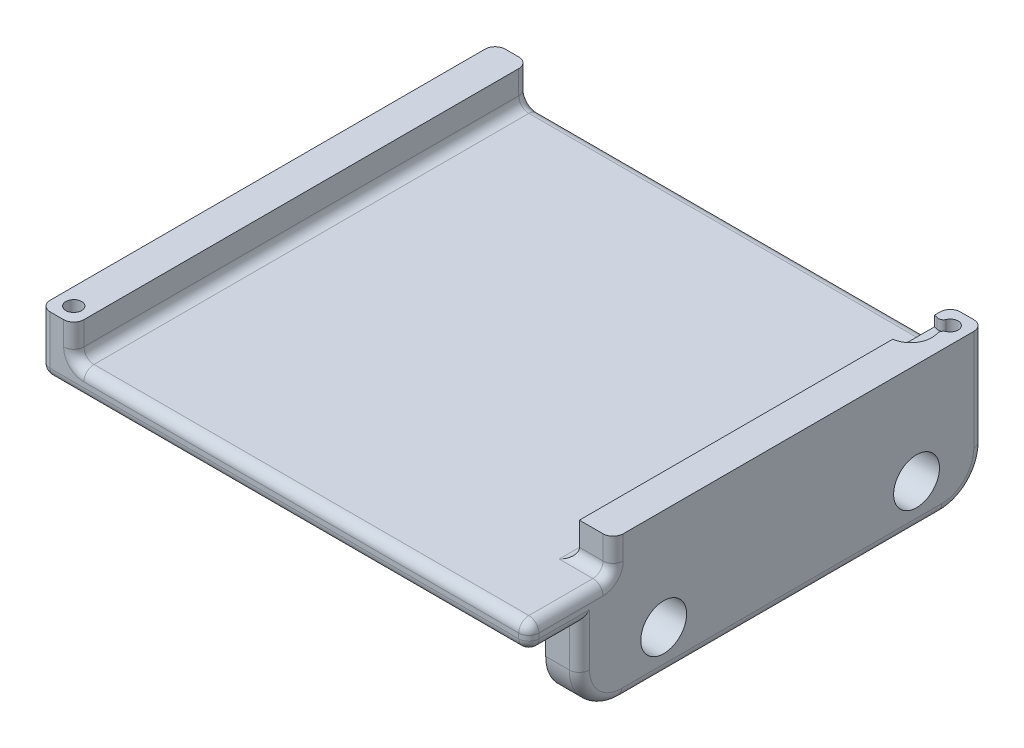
ISO-10303-21;
HEADER;
FILE_DESCRIPTION(('STEP AP214'),'2;1');
FILE_NAME('part.step','',(''),(''),'','','');
FILE_SCHEMA(('AUTOMOTIVE_DESIGN { 1 0 10303 214 1 1 1 1 }'));
ENDSEC;
DATA;
#1=APPLICATION_CONTEXT('core data for automotive mechanical design processes');
#2=APPLICATION_PROTOCOL_DEFINITION('international standard','automotive_design',2000,#1);
#3=PRODUCT_CONTEXT('',#1,'mechanical');
#4=PRODUCT('Part','Part','',(#3));
#5=PRODUCT_RELATED_PRODUCT_CATEGORY('part','',(#4));
#6=PRODUCT_DEFINITION_FORMATION('','',#4);
#7=PRODUCT_DEFINITION_CONTEXT('part definition',#1,'design');
#8=PRODUCT_DEFINITION('design','',#6,#7);
#9=PRODUCT_DEFINITION_SHAPE('','',#8);
#10=(LENGTH_UNIT() NAMED_UNIT(*) SI_UNIT(.MILLI.,.METRE.));
#11=(NAMED_UNIT(*) PLANE_ANGLE_UNIT() SI_UNIT($,.RADIAN.));
#12=(NAMED_UNIT(*) SI_UNIT($,.STERADIAN.) SOLID_ANGLE_UNIT());
#13=UNCERTAINTY_MEASURE_WITH_UNIT(LENGTH_MEASURE(1.E-05),#10,'distance_accuracy_value','');
#14=(GEOMETRIC_REPRESENTATION_CONTEXT(3) GLOBAL_UNCERTAINTY_ASSIGNED_CONTEXT((#13)) GLOBAL_UNIT_ASSIGNED_CONTEXT((#10,
#11,#12)) REPRESENTATION_CONTEXT('',''));
#15=CARTESIAN_POINT('',(0.,0.,0.));
#16=DIRECTION('',(0.,0.,1.));
#17=DIRECTION('',(1.,0.,0.));
#18=AXIS2_PLACEMENT_3D('',#15,#16,#17);
#19=CARTESIAN_POINT('',(0.,0.,0.));
#20=DIRECTION('',(0.,-1.,0.));
#21=DIRECTION('',(0.,0.,-1.));
#22=AXIS2_PLACEMENT_3D('',#19,#20,#21);
#23=PLANE('',#22);
#24=DIRECTION('',(1.,0.,0.));
#25=VECTOR('',#24,1.);
#26=CARTESIAN_POINT('',(15.8749999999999,9.99200722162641E-13,13.335));
#27=LINE('',#26,#25);
#28=CARTESIAN_POINT('',(15.8749999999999,9.99200722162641E-13,13.335));
#29=VERTEX_POINT('',#28);
#30=CARTESIAN_POINT('',(17.6529999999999,9.99200722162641E-13,13.335));
#31=VERTEX_POINT('',#30);
#32=EDGE_CURVE('E413',#29,#31,#27,.T.);
#33=ORIENTED_EDGE('',*,*,#32,.T.);
#34=DIRECTION('',(0.,0.,-1.));
#35=VECTOR('',#34,1.);
#36=CARTESIAN_POINT('',(17.653,1.38777878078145E-12,16.383));
#37=LINE('',#36,#35);
#38=CARTESIAN_POINT('',(17.653,1.38777878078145E-12,16.383));
#39=VERTEX_POINT('',#38);
#40=EDGE_CURVE('E606',#31,#39,#37,.F.);
#41=ORIENTED_EDGE('',*,*,#40,.T.);
#42=DIRECTION('',(1.,0.,0.));
#43=VECTOR('',#42,1.);
#44=CARTESIAN_POINT('',(-17.653,0.,16.383));
#45=LINE('',#44,#43);
#46=CARTESIAN_POINT('',(-16.8340159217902,0.,16.383));
#47=VERTEX_POINT('',#46);
#48=EDGE_CURVE('E604',#39,#47,#45,.F.);
#49=ORIENTED_EDGE('',*,*,#48,.T.);
#50=CARTESIAN_POINT('',(-17.145,2.22044604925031E-13,15.875));
#51=DIRECTION('',(0.,-1.,0.));
#52=DIRECTION('',(0.,0.,-1.));
#53=AXIS2_PLACEMENT_3D('',#50,#51,#52);
#54=CIRCLE('',#53,0.595629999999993);
#55=CARTESIAN_POINT('',(-17.653,2.22044604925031E-13,15.5640159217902));
#56=VERTEX_POINT('',#55);
#57=EDGE_CURVE('E438',#56,#47,#54,.T.);
#58=ORIENTED_EDGE('',*,*,#57,.F.);
#59=DIRECTION('',(0.,0.,1.));
#60=VECTOR('',#59,1.);
#61=CARTESIAN_POINT('',(-17.653,0.,-16.383));
#62=LINE('',#61,#60);
#63=CARTESIAN_POINT('',(-17.653,0.,-16.383));
#64=VERTEX_POINT('',#63);
#65=EDGE_CURVE('E595',#56,#64,#62,.F.);
#66=ORIENTED_EDGE('',*,*,#65,.T.);
#67=DIRECTION('',(-1.,0.,0.));
#68=VECTOR('',#67,1.);
#69=CARTESIAN_POINT('',(15.8749999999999,1.38777878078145E-12,-16.383));
#70=LINE('',#69,#68);
#71=CARTESIAN_POINT('',(15.8749999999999,1.38777878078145E-12,-16.383));
#72=VERTEX_POINT('',#71);
#73=EDGE_CURVE('E597',#64,#72,#70,.F.);
#74=ORIENTED_EDGE('',*,*,#73,.T.);
#75=DIRECTION('',(0.,0.,1.));
#76=VECTOR('',#75,1.);
#77=CARTESIAN_POINT('',(15.8749999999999,9.99200722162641E-13,13.335));
#78=LINE('',#77,#76);
#79=EDGE_CURVE('E410',#72,#29,#78,.T.);
#80=ORIENTED_EDGE('',*,*,#79,.T.);
#81=EDGE_LOOP('',(#33,#41,#49,#58,#66,#74,#80));
#82=FACE_BOUND('',#81,.T.);
#83=ADVANCED_FACE('F44',(#82),#23,.T.);
#84=CARTESIAN_POINT('',(0.,1.90499999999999,0.));
#85=DIRECTION('',(0.,-1.,0.));
#86=DIRECTION('',(0.,0.,-1.));
#87=AXIS2_PLACEMENT_3D('',#84,#85,#86);
#88=PLANE('',#87);
#89=DIRECTION('',(0.,0.,-1.));
#90=VECTOR('',#89,1.);
#91=CARTESIAN_POINT('',(17.653,1.90500000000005,0.));
#92=LINE('',#91,#90);
#93=CARTESIAN_POINT('',(17.653,1.90500000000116,16.383));
#94=VERTEX_POINT('',#93);
#95=CARTESIAN_POINT('',(17.653,1.90500000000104,11.557));
#96=VERTEX_POINT('',#95);
#97=EDGE_CURVE('E1029',#94,#96,#92,.T.);
#98=ORIENTED_EDGE('',*,*,#97,.T.);
#99=DIRECTION('',(1.,0.,0.));
#100=VECTOR('',#99,1.);
#101=CARTESIAN_POINT('',(15.875,1.90500000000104,11.557));
#102=LINE('',#101,#100);
#103=CARTESIAN_POINT('',(15.113,1.90500000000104,11.557));
#104=VERTEX_POINT('',#103);
#105=EDGE_CURVE('E925',#96,#104,#102,.F.);
#106=ORIENTED_EDGE('',*,*,#105,.T.);
#107=DIRECTION('',(0.,0.,1.));
#108=VECTOR('',#107,1.);
#109=CARTESIAN_POINT('',(15.113,1.90500000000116,-17.145));
#110=LINE('',#109,#108);
#111=CARTESIAN_POINT('',(15.113,1.90500000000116,-16.383));
#112=VERTEX_POINT('',#111);
#113=EDGE_CURVE('E463',#104,#112,#110,.F.);
#114=ORIENTED_EDGE('',*,*,#113,.T.);
#115=DIRECTION('',(-1.,0.,0.));
#116=VECTOR('',#115,1.);
#117=CARTESIAN_POINT('',(0.,1.90500000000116,-16.383));
#118=LINE('',#117,#116);
#119=CARTESIAN_POINT('',(-15.113,1.90500000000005,-16.383));
#120=VERTEX_POINT('',#119);
#121=EDGE_CURVE('E1019',#112,#120,#118,.T.);
#122=ORIENTED_EDGE('',*,*,#121,.T.);
#123=DIRECTION('',(0.,0.,-1.));
#124=VECTOR('',#123,1.);
#125=CARTESIAN_POINT('',(-15.113,1.90500000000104,17.145));
#126=LINE('',#125,#124);
#127=CARTESIAN_POINT('',(-15.113,1.90500000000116,16.383));
#128=VERTEX_POINT('',#127);
#129=EDGE_CURVE('E1022',#120,#128,#126,.F.);
#130=ORIENTED_EDGE('',*,*,#129,.T.);
#131=DIRECTION('',(1.,0.,0.));
#132=VECTOR('',#131,1.);
#133=CARTESIAN_POINT('',(0.,1.90500000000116,16.383));
#134=LINE('',#133,#132);
#135=EDGE_CURVE('E1024',#128,#94,#134,.T.);
#136=ORIENTED_EDGE('',*,*,#135,.T.);
#137=EDGE_LOOP('',(#98,#106,#114,#122,#130,#136));
#138=FACE_BOUND('',#137,.T.);
#139=ADVANCED_FACE('F640',(#138),#88,.F.);
#140=CARTESIAN_POINT('',(-17.4559840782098,0.,16.383));
#141=VERTEX_POINT('',#140);
#142=CARTESIAN_POINT('',(-17.653,2.22044604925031E-13,16.1859840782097));
#143=VERTEX_POINT('',#142);
#144=EDGE_CURVE('E623',#141,#143,#54,.T.);
#145=ORIENTED_EDGE('',*,*,#144,.F.);
#146=DIRECTION('',(1.,0.,0.));
#147=VECTOR('',#146,1.);
#148=CARTESIAN_POINT('',(-17.653,0.,16.383));
#149=LINE('',#148,#147);
#150=CARTESIAN_POINT('',(-17.653,0.,16.383));
#151=VERTEX_POINT('',#150);
#152=EDGE_CURVE('E602',#141,#151,#149,.F.);
#153=ORIENTED_EDGE('',*,*,#152,.T.);
#154=DIRECTION('',(0.,0.,1.));
#155=VECTOR('',#154,1.);
#156=CARTESIAN_POINT('',(-17.653,0.,-16.383));
#157=LINE('',#156,#155);
#158=EDGE_CURVE('E600',#151,#143,#157,.F.);
#159=ORIENTED_EDGE('',*,*,#158,.T.);
#160=EDGE_LOOP('',(#145,#153,#159));
#161=FACE_BOUND('',#160,.T.);
#162=ADVANCED_FACE('F642',(#161),#23,.T.);
#163=CARTESIAN_POINT('',(18.415,1.90500000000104,17.145));
#164=DIRECTION('',(-1.,0.,0.));
#165=DIRECTION('',(0.,0.,1.));
#166=AXIS2_PLACEMENT_3D('',#163,#164,#165);
#167=PLANE('',#166);
#168=CARTESIAN_POINT('',(18.4149999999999,-3.17499999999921,-12.065));
#169=DIRECTION('',(1.,0.,0.));
#170=DIRECTION('',(0.,0.,-1.));
#171=AXIS2_PLACEMENT_3D('',#168,#169,#170);
#172=CIRCLE('',#171,1.7272);
#173=CARTESIAN_POINT('',(18.4149999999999,-3.17499999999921,-13.7922));
#174=VERTEX_POINT('',#173);
#175=EDGE_CURVE('E386',#174,#174,#172,.T.);
#176=ORIENTED_EDGE('',*,*,#175,.F.);
#177=EDGE_LOOP('',(#176));
#178=FACE_BOUND('',#177,.T.);
#179=CARTESIAN_POINT('',(18.415,-3.17499999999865,6.98499999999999));
#180=DIRECTION('',(1.,0.,0.));
#181=DIRECTION('',(0.,0.,-1.));
#182=AXIS2_PLACEMENT_3D('',#179,#180,#181);
#183=CIRCLE('',#182,1.7272);
#184=CARTESIAN_POINT('',(18.415,-3.17499999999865,5.25779999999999));
#185=VERTEX_POINT('',#184);
#186=EDGE_CURVE('E393',#185,#185,#183,.T.);
#187=ORIENTED_EDGE('',*,*,#186,.F.);
#188=EDGE_LOOP('',(#187));
#189=FACE_BOUND('',#188,.T.);
#190=DIRECTION('',(0.,-1.,0.));
#191=VECTOR('',#190,1.);
#192=CARTESIAN_POINT('',(18.415,1.90500000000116,16.383));
#193=LINE('',#192,#191);
#194=CARTESIAN_POINT('',(18.415,1.14300000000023,16.383));
#195=VERTEX_POINT('',#194);
#196=CARTESIAN_POINT('',(18.415,0.76200000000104,16.383));
#197=VERTEX_POINT('',#196);
#198=EDGE_CURVE('E668',#195,#197,#193,.T.);
#199=ORIENTED_EDGE('',*,*,#198,.T.);
#200=DIRECTION('',(0.,0.,-1.));
#201=VECTOR('',#200,1.);
#202=CARTESIAN_POINT('',(18.415,0.762000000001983,12.573));
#203=LINE('',#202,#201);
#204=CARTESIAN_POINT('',(18.415,0.762000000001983,12.573));
#205=VERTEX_POINT('',#204);
#206=EDGE_CURVE('E592',#197,#205,#203,.T.);
#207=ORIENTED_EDGE('',*,*,#206,.T.);
#208=DIRECTION('',(0.,-1.,0.));
#209=VECTOR('',#208,1.);
#210=CARTESIAN_POINT('',(18.415,-3.17499999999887,12.573));
#211=LINE('',#210,#209);
#212=CARTESIAN_POINT('',(18.415,-3.17499999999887,12.573));
#213=VERTEX_POINT('',#212);
#214=EDGE_CURVE('E676',#205,#213,#211,.T.);
#215=ORIENTED_EDGE('',*,*,#214,.T.);
#216=CARTESIAN_POINT('',(18.4149999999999,-3.17499999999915,10.16));
#217=DIRECTION('',(-1.,0.,0.));
#218=DIRECTION('',(0.,0.,1.));
#219=AXIS2_PLACEMENT_3D('',#216,#217,#218);
#220=CIRCLE('',#219,2.413);
#221=CARTESIAN_POINT('',(18.415,-5.58799999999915,10.16));
#222=VERTEX_POINT('',#221);
#223=EDGE_CURVE('E680',#213,#222,#220,.F.);
#224=ORIENTED_EDGE('',*,*,#223,.T.);
#225=DIRECTION('',(0.,0.,-1.));
#226=VECTOR('',#225,1.);
#227=CARTESIAN_POINT('',(18.415,-5.58799999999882,-13.97));
#228=LINE('',#227,#226);
#229=CARTESIAN_POINT('',(18.415,-5.58799999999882,-13.97));
#230=VERTEX_POINT('',#229);
#231=EDGE_CURVE('E799',#222,#230,#228,.T.);
#232=ORIENTED_EDGE('',*,*,#231,.T.);
#233=CARTESIAN_POINT('',(18.4149999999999,-3.17499999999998,-13.97));
#234=DIRECTION('',(-1.,0.,0.));
#235=DIRECTION('',(0.,0.,1.));
#236=AXIS2_PLACEMENT_3D('',#233,#234,#235);
#237=CIRCLE('',#236,2.413);
#238=CARTESIAN_POINT('',(18.4149999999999,-3.17499999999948,-16.383));
#239=VERTEX_POINT('',#238);
#240=EDGE_CURVE('E777',#230,#239,#237,.F.);
#241=ORIENTED_EDGE('',*,*,#240,.T.);
#242=DIRECTION('',(0.,-1.,0.));
#243=VECTOR('',#242,1.);
#244=CARTESIAN_POINT('',(18.415,1.90500000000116,-16.383));
#245=LINE('',#244,#243);
#246=CARTESIAN_POINT('',(18.4149999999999,4.44500000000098,-16.383));
#247=VERTEX_POINT('',#246);
#248=EDGE_CURVE('E1013',#239,#247,#245,.F.);
#249=ORIENTED_EDGE('',*,*,#248,.T.);
#250=DIRECTION('',(0.,0.,-1.));
#251=VECTOR('',#250,1.);
#252=CARTESIAN_POINT('',(18.415,4.44500000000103,10.795));
#253=LINE('',#252,#251);
#254=CARTESIAN_POINT('',(18.415,4.44500000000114,10.033));
#255=VERTEX_POINT('',#254);
#256=EDGE_CURVE('E366',#255,#247,#253,.T.);
#257=ORIENTED_EDGE('',*,*,#256,.F.);
#258=DIRECTION('',(0.,-1.,0.));
#259=VECTOR('',#258,1.);
#260=CARTESIAN_POINT('',(18.415,1.90500000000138,10.033));
#261=LINE('',#260,#259);
#262=CARTESIAN_POINT('',(18.415,2.66700000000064,10.033));
#263=VERTEX_POINT('',#262);
#264=EDGE_CURVE('E687',#255,#263,#261,.T.);
#265=ORIENTED_EDGE('',*,*,#264,.T.);
#266=CARTESIAN_POINT('',(18.415,2.66700000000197,11.557));
#267=DIRECTION('',(-1.,0.,0.));
#268=DIRECTION('',(0.,0.,1.));
#269=AXIS2_PLACEMENT_3D('',#266,#267,#268);
#270=CIRCLE('',#269,1.524);
#271=CARTESIAN_POINT('',(18.415,1.14300000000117,11.557));
#272=VERTEX_POINT('',#271);
#273=EDGE_CURVE('E678',#272,#263,#270,.F.);
#274=ORIENTED_EDGE('',*,*,#273,.F.);
#275=DIRECTION('',(0.,0.,-1.));
#276=VECTOR('',#275,1.);
#277=CARTESIAN_POINT('',(18.415,1.14300000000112,17.145));
#278=LINE('',#277,#276);
#279=EDGE_CURVE('E675',#272,#195,#278,.F.);
#280=ORIENTED_EDGE('',*,*,#279,.T.);
#281=EDGE_LOOP('',(#199,#207,#215,#224,#232,#241,#249,#257,#265,#274,#280));
#282=FACE_BOUND('',#281,.T.);
#283=ADVANCED_FACE('F650',(#178,#189,#282),#167,.F.);
#284=CARTESIAN_POINT('',(-18.415,1.90499999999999,-17.145));
#285=DIRECTION('',(0.,0.,1.));
#286=DIRECTION('',(1.,0.,0.));
#287=AXIS2_PLACEMENT_3D('',#284,#285,#286);
#288=PLANE('',#287);
#289=DIRECTION('',(0.,1.,0.));
#290=VECTOR('',#289,1.);
#291=CARTESIAN_POINT('',(15.875,2.22044604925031E-13,-17.145));
#292=LINE('',#291,#290);
#293=CARTESIAN_POINT('',(15.875,-3.17499999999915,-17.145));
#294=VERTEX_POINT('',#293);
#295=CARTESIAN_POINT('',(15.875,0.762000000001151,-17.145));
#296=VERTEX_POINT('',#295);
#297=EDGE_CURVE('E408',#294,#296,#292,.T.);
#298=ORIENTED_EDGE('',*,*,#297,.T.);
#299=DIRECTION('',(-1.,0.,0.));
#300=VECTOR('',#299,1.);
#301=CARTESIAN_POINT('',(-17.653,0.762000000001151,-17.145));
#302=LINE('',#301,#300);
#303=CARTESIAN_POINT('',(-17.653,0.762000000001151,-17.145));
#304=VERTEX_POINT('',#303);
#305=EDGE_CURVE('E608',#296,#304,#302,.T.);
#306=ORIENTED_EDGE('',*,*,#305,.T.);
#307=DIRECTION('',(0.,-1.,0.));
#308=VECTOR('',#307,1.);
#309=CARTESIAN_POINT('',(-17.653,1.90499999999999,-17.145));
#310=LINE('',#309,#308);
#311=CARTESIAN_POINT('',(-17.653,4.44499999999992,-17.145));
#312=VERTEX_POINT('',#311);
#313=EDGE_CURVE('E733',#304,#312,#310,.F.);
#314=ORIENTED_EDGE('',*,*,#313,.T.);
#315=DIRECTION('',(-1.,0.,0.));
#316=VECTOR('',#315,1.);
#317=CARTESIAN_POINT('',(-18.415,4.44499999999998,-17.145));
#318=LINE('',#317,#316);
#319=CARTESIAN_POINT('',(-16.637,4.44499999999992,-17.145));
#320=VERTEX_POINT('',#319);
#321=EDGE_CURVE('E378',#320,#312,#318,.T.);
#322=ORIENTED_EDGE('',*,*,#321,.F.);
#323=DIRECTION('',(0.,-1.,0.));
#324=VECTOR('',#323,1.);
#325=CARTESIAN_POINT('',(-16.637,1.90499999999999,-17.145));
#326=LINE('',#325,#324);
#327=CARTESIAN_POINT('',(-16.6369999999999,2.66700000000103,-17.145));
#328=VERTEX_POINT('',#327);
#329=EDGE_CURVE('E748',#320,#328,#326,.T.);
#330=ORIENTED_EDGE('',*,*,#329,.T.);
#331=CARTESIAN_POINT('',(-15.113,2.66700000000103,-17.145));
#332=DIRECTION('',(0.,0.,1.));
#333=DIRECTION('',(1.,0.,0.));
#334=AXIS2_PLACEMENT_3D('',#331,#332,#333);
#335=CIRCLE('',#334,1.524);
#336=CARTESIAN_POINT('',(-15.113,1.14300000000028,-17.145));
#337=VERTEX_POINT('',#336);
#338=EDGE_CURVE('E744',#337,#328,#335,.F.);
#339=ORIENTED_EDGE('',*,*,#338,.F.);
#340=DIRECTION('',(-1.,0.,0.));
#341=VECTOR('',#340,1.);
#342=CARTESIAN_POINT('',(-18.415,1.14300000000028,-17.1449999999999));
#343=LINE('',#342,#341);
#344=CARTESIAN_POINT('',(15.113,1.1430000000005,-17.145));
#345=VERTEX_POINT('',#344);
#346=EDGE_CURVE('E739',#337,#345,#343,.F.);
#347=ORIENTED_EDGE('',*,*,#346,.T.);
#348=CARTESIAN_POINT('',(15.113,2.66700000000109,-17.145));
#349=DIRECTION('',(0.,0.,1.));
#350=DIRECTION('',(1.,0.,0.));
#351=AXIS2_PLACEMENT_3D('',#348,#349,#350);
#352=CIRCLE('',#351,1.524);
#353=CARTESIAN_POINT('',(16.637,2.66700000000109,-17.145));
#354=VERTEX_POINT('',#353);
#355=EDGE_CURVE('E736',#354,#345,#352,.F.);
#356=ORIENTED_EDGE('',*,*,#355,.F.);
#357=DIRECTION('',(0.,-1.,0.));
#358=VECTOR('',#357,1.);
#359=CARTESIAN_POINT('',(16.637,1.90500000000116,-17.145));
#360=LINE('',#359,#358);
#361=CARTESIAN_POINT('',(16.637,4.44500000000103,-17.145));
#362=VERTEX_POINT('',#361);
#363=EDGE_CURVE('E742',#354,#362,#360,.F.);
#364=ORIENTED_EDGE('',*,*,#363,.T.);
#365=DIRECTION('',(-1.,0.,0.));
#366=VECTOR('',#365,1.);
#367=CARTESIAN_POINT('',(15.875,4.44500000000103,-17.145));
#368=LINE('',#367,#366);
#369=CARTESIAN_POINT('',(17.653,4.44500000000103,-17.1449999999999));
#370=VERTEX_POINT('',#369);
#371=EDGE_CURVE('E353',#370,#362,#368,.T.);
#372=ORIENTED_EDGE('',*,*,#371,.F.);
#373=DIRECTION('',(0.,-1.,0.));
#374=VECTOR('',#373,1.);
#375=CARTESIAN_POINT('',(17.653,1.90500000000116,-17.1449999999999));
#376=LINE('',#375,#374);
#377=CARTESIAN_POINT('',(17.653,-3.17499999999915,-17.145));
#378=VERTEX_POINT('',#377);
#379=EDGE_CURVE('E731',#370,#378,#376,.T.);
#380=ORIENTED_EDGE('',*,*,#379,.T.);
#381=DIRECTION('',(1.,0.,0.));
#382=VECTOR('',#381,1.);
#383=CARTESIAN_POINT('',(15.875,-3.17499999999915,-17.145));
#384=LINE('',#383,#382);
#385=EDGE_CURVE('E421',#378,#294,#384,.F.);
#386=ORIENTED_EDGE('',*,*,#385,.T.);
#387=EDGE_LOOP('',(#298,#306,#314,#322,#330,#339,#347,#356,#364,#372,#380,#386));
#388=FACE_BOUND('',#387,.T.);
#389=ADVANCED_FACE('F655',(#388),#288,.F.);
#390=CARTESIAN_POINT('',(-18.415,1.90500000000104,17.145));
#391=DIRECTION('',(1.,0.,0.));
#392=DIRECTION('',(0.,0.,-1.));
#393=AXIS2_PLACEMENT_3D('',#390,#391,#392);
#394=PLANE('',#393);
#395=DIRECTION('',(0.,-1.,0.));
#396=VECTOR('',#395,1.);
#397=CARTESIAN_POINT('',(-18.415,1.90500000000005,-16.383));
#398=LINE('',#397,#396);
#399=CARTESIAN_POINT('',(-18.4150000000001,4.44499999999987,-16.383));
#400=VERTEX_POINT('',#399);
#401=CARTESIAN_POINT('',(-18.415,0.76200000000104,-16.383));
#402=VERTEX_POINT('',#401);
#403=EDGE_CURVE('E921',#400,#402,#398,.T.);
#404=ORIENTED_EDGE('',*,*,#403,.T.);
#405=DIRECTION('',(0.,0.,1.));
#406=VECTOR('',#405,1.);
#407=CARTESIAN_POINT('',(-18.415,0.76200000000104,16.383));
#408=LINE('',#407,#406);
#409=CARTESIAN_POINT('',(-18.415,0.76200000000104,16.383));
#410=VERTEX_POINT('',#409);
#411=EDGE_CURVE('E524',#402,#410,#408,.T.);
#412=ORIENTED_EDGE('',*,*,#411,.T.);
#413=DIRECTION('',(0.,-1.,0.));
#414=VECTOR('',#413,1.);
#415=CARTESIAN_POINT('',(-18.415,1.90500000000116,16.383));
#416=LINE('',#415,#414);
#417=CARTESIAN_POINT('',(-18.415,4.44499999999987,16.383));
#418=VERTEX_POINT('',#417);
#419=EDGE_CURVE('E574',#410,#418,#416,.F.);
#420=ORIENTED_EDGE('',*,*,#419,.T.);
#421=DIRECTION('',(0.,0.,1.));
#422=VECTOR('',#421,1.);
#423=CARTESIAN_POINT('',(-18.4150000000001,4.44500000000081,17.145));
#424=LINE('',#423,#422);
#425=EDGE_CURVE('E382',#400,#418,#424,.T.);
#426=ORIENTED_EDGE('',*,*,#425,.F.);
#427=EDGE_LOOP('',(#404,#412,#420,#426));
#428=FACE_BOUND('',#427,.T.);
#429=ADVANCED_FACE('F906',(#428),#394,.F.);
#430=CARTESIAN_POINT('',(-18.415,1.90500000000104,17.145));
#431=DIRECTION('',(0.,0.,-1.));
#432=DIRECTION('',(-1.,0.,0.));
#433=AXIS2_PLACEMENT_3D('',#430,#431,#432);
#434=PLANE('',#433);
#435=DIRECTION('',(0.,-1.,0.));
#436=VECTOR('',#435,1.);
#437=CARTESIAN_POINT('',(-17.653,1.90500000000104,17.145));
#438=LINE('',#437,#436);
#439=CARTESIAN_POINT('',(-17.6530000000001,4.44500000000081,17.145));
#440=VERTEX_POINT('',#439);
#441=CARTESIAN_POINT('',(-17.653,0.762000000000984,17.145));
#442=VERTEX_POINT('',#441);
#443=EDGE_CURVE('E719',#440,#442,#438,.T.);
#444=ORIENTED_EDGE('',*,*,#443,.T.);
#445=DIRECTION('',(1.,0.,0.));
#446=VECTOR('',#445,1.);
#447=CARTESIAN_POINT('',(17.6529999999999,0.76200000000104,17.145));
#448=LINE('',#447,#446);
#449=CARTESIAN_POINT('',(17.6529999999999,0.76200000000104,17.145));
#450=VERTEX_POINT('',#449);
#451=EDGE_CURVE('E611',#442,#450,#448,.T.);
#452=ORIENTED_EDGE('',*,*,#451,.T.);
#453=DIRECTION('',(0.,-1.,0.));
#454=VECTOR('',#453,1.);
#455=CARTESIAN_POINT('',(17.653,1.90500000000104,17.145));
#456=LINE('',#455,#454);
#457=CARTESIAN_POINT('',(17.653,1.14300000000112,17.145));
#458=VERTEX_POINT('',#457);
#459=EDGE_CURVE('E670',#450,#458,#456,.F.);
#460=ORIENTED_EDGE('',*,*,#459,.T.);
#461=DIRECTION('',(1.,0.,0.));
#462=VECTOR('',#461,1.);
#463=CARTESIAN_POINT('',(-18.415,1.14300000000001,17.145));
#464=LINE('',#463,#462);
#465=CARTESIAN_POINT('',(-15.113,1.14300000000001,17.145));
#466=VERTEX_POINT('',#465);
#467=EDGE_CURVE('E712',#458,#466,#464,.F.);
#468=ORIENTED_EDGE('',*,*,#467,.T.);
#469=CARTESIAN_POINT('',(-15.113,2.66700000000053,17.145));
#470=DIRECTION('',(0.,0.,-1.));
#471=DIRECTION('',(-1.,0.,0.));
#472=AXIS2_PLACEMENT_3D('',#469,#470,#471);
#473=CIRCLE('',#472,1.524);
#474=CARTESIAN_POINT('',(-16.637,2.66700000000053,17.145));
#475=VERTEX_POINT('',#474);
#476=EDGE_CURVE('E714',#475,#466,#473,.F.);
#477=ORIENTED_EDGE('',*,*,#476,.F.);
#478=DIRECTION('',(0.,-1.,0.));
#479=VECTOR('',#478,1.);
#480=CARTESIAN_POINT('',(-16.637,1.90500000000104,17.145));
#481=LINE('',#480,#479);
#482=CARTESIAN_POINT('',(-16.6370000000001,4.44500000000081,17.145));
#483=VERTEX_POINT('',#482);
#484=EDGE_CURVE('E717',#475,#483,#481,.F.);
#485=ORIENTED_EDGE('',*,*,#484,.T.);
#486=DIRECTION('',(1.,0.,0.));
#487=VECTOR('',#486,1.);
#488=CARTESIAN_POINT('',(-18.4150000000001,4.44500000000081,17.145));
#489=LINE('',#488,#487);
#490=EDGE_CURVE('E371',#440,#483,#489,.T.);
#491=ORIENTED_EDGE('',*,*,#490,.F.);
#492=EDGE_LOOP('',(#444,#452,#460,#468,#477,#485,#491));
#493=FACE_BOUND('',#492,.T.);
#494=ADVANCED_FACE('F902',(#493),#434,.F.);
#495=CARTESIAN_POINT('',(15.8749999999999,9.99200722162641E-13,13.335));
#496=DIRECTION('',(0.,0.,1.));
#497=DIRECTION('',(1.,0.,0.));
#498=AXIS2_PLACEMENT_3D('',#495,#496,#497);
#499=PLANE('',#498);
#500=DIRECTION('',(1.,0.,0.));
#501=VECTOR('',#500,1.);
#502=CARTESIAN_POINT('',(15.8749999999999,-3.17499999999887,13.335));
#503=LINE('',#502,#501);
#504=CARTESIAN_POINT('',(15.8749999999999,-3.17499999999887,13.335));
#505=VERTEX_POINT('',#504);
#506=CARTESIAN_POINT('',(17.6529999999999,-3.17499999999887,13.335));
#507=VERTEX_POINT('',#506);
#508=EDGE_CURVE('E427',#505,#507,#503,.T.);
#509=ORIENTED_EDGE('',*,*,#508,.T.);
#510=DIRECTION('',(0.,-1.,0.));
#511=VECTOR('',#510,1.);
#512=CARTESIAN_POINT('',(17.6529999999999,9.99200722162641E-13,13.335));
#513=LINE('',#512,#511);
#514=EDGE_CURVE('E756',#507,#31,#513,.F.);
#515=ORIENTED_EDGE('',*,*,#514,.T.);
#516=ORIENTED_EDGE('',*,*,#32,.F.);
#517=DIRECTION('',(0.,-1.,0.));
#518=VECTOR('',#517,1.);
#519=CARTESIAN_POINT('',(15.8749999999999,9.99200722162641E-13,13.335));
#520=LINE('',#519,#518);
#521=EDGE_CURVE('E401',#29,#505,#520,.T.);
#522=ORIENTED_EDGE('',*,*,#521,.T.);
#523=EDGE_LOOP('',(#509,#515,#516,#522));
#524=FACE_BOUND('',#523,.T.);
#525=ADVANCED_FACE('F797',(#524),#499,.T.);
#526=CARTESIAN_POINT('',(15.8749999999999,-6.3499999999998,13.335));
#527=DIRECTION('',(0.,-1.,0.));
#528=DIRECTION('',(0.,0.,-1.));
#529=AXIS2_PLACEMENT_3D('',#526,#527,#528);
#530=PLANE('',#529);
#531=DIRECTION('',(1.,0.,0.));
#532=VECTOR('',#531,1.);
#533=CARTESIAN_POINT('',(18.415,-6.34999999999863,-13.97));
#534=LINE('',#533,#532);
#535=CARTESIAN_POINT('',(15.875,-6.34999999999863,-13.97));
#536=VERTEX_POINT('',#535);
#537=CARTESIAN_POINT('',(17.653,-6.34999999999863,-13.97));
#538=VERTEX_POINT('',#537);
#539=EDGE_CURVE('E418',#536,#538,#534,.T.);
#540=ORIENTED_EDGE('',*,*,#539,.T.);
#541=DIRECTION('',(0.,0.,-1.));
#542=VECTOR('',#541,1.);
#543=CARTESIAN_POINT('',(17.653,-6.34999999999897,10.16));
#544=LINE('',#543,#542);
#545=CARTESIAN_POINT('',(17.653,-6.34999999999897,10.16));
#546=VERTEX_POINT('',#545);
#547=EDGE_CURVE('E761',#538,#546,#544,.F.);
#548=ORIENTED_EDGE('',*,*,#547,.T.);
#549=DIRECTION('',(1.,0.,0.));
#550=VECTOR('',#549,1.);
#551=CARTESIAN_POINT('',(15.875,-6.34999999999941,10.1599999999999));
#552=LINE('',#551,#550);
#553=CARTESIAN_POINT('',(15.875,-6.34999999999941,10.1599999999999));
#554=VERTEX_POINT('',#553);
#555=EDGE_CURVE('E416',#546,#554,#552,.F.);
#556=ORIENTED_EDGE('',*,*,#555,.T.);
#557=DIRECTION('',(0.,0.,-1.));
#558=VECTOR('',#557,1.);
#559=CARTESIAN_POINT('',(15.8749999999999,-6.3499999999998,13.335));
#560=LINE('',#559,#558);
#561=EDGE_CURVE('E404',#554,#536,#560,.T.);
#562=ORIENTED_EDGE('',*,*,#561,.T.);
#563=EDGE_LOOP('',(#540,#548,#556,#562));
#564=FACE_BOUND('',#563,.T.);
#565=ADVANCED_FACE('F784',(#564),#530,.T.);
#566=CARTESIAN_POINT('',(15.875,2.22044604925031E-13,0.));
#567=DIRECTION('',(1.,0.,0.));
#568=DIRECTION('',(0.,0.,-1.));
#569=AXIS2_PLACEMENT_3D('',#566,#567,#568);
#570=PLANE('',#569);
#571=CARTESIAN_POINT('',(15.8749999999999,-3.17499999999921,-12.065));
#572=DIRECTION('',(1.,0.,0.));
#573=DIRECTION('',(0.,0.,-1.));
#574=AXIS2_PLACEMENT_3D('',#571,#572,#573);
#575=CIRCLE('',#574,1.7272);
#576=CARTESIAN_POINT('',(15.8749999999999,-3.17499999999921,-13.7922));
#577=VERTEX_POINT('',#576);
#578=EDGE_CURVE('E390',#577,#577,#575,.T.);
#579=ORIENTED_EDGE('',*,*,#578,.T.);
#580=EDGE_LOOP('',(#579));
#581=FACE_BOUND('',#580,.T.);
#582=CARTESIAN_POINT('',(15.875,-3.17499999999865,6.98500000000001));
#583=DIRECTION('',(1.,0.,0.));
#584=DIRECTION('',(0.,0.,-1.));
#585=AXIS2_PLACEMENT_3D('',#582,#583,#584);
#586=CIRCLE('',#585,1.7272);
#587=CARTESIAN_POINT('',(15.875,-3.17499999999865,5.25780000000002));
#588=VERTEX_POINT('',#587);
#589=EDGE_CURVE('E397',#588,#588,#586,.T.);
#590=ORIENTED_EDGE('',*,*,#589,.T.);
#591=EDGE_LOOP('',(#590));
#592=FACE_BOUND('',#591,.T.);
#593=ORIENTED_EDGE('',*,*,#297,.F.);
#594=CARTESIAN_POINT('',(15.8749999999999,-3.17499999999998,-13.97));
#595=DIRECTION('',(1.,0.,0.));
#596=DIRECTION('',(0.,0.,-1.));
#597=AXIS2_PLACEMENT_3D('',#594,#595,#596);
#598=CIRCLE('',#597,3.175);
#599=EDGE_CURVE('E425',#294,#536,#598,.F.);
#600=ORIENTED_EDGE('',*,*,#599,.T.);
#601=ORIENTED_EDGE('',*,*,#561,.F.);
#602=CARTESIAN_POINT('',(15.8749999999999,-3.17499999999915,10.16));
#603=DIRECTION('',(1.,0.,0.));
#604=DIRECTION('',(0.,0.,-1.));
#605=AXIS2_PLACEMENT_3D('',#602,#603,#604);
#606=CIRCLE('',#605,3.175);
#607=EDGE_CURVE('E423',#554,#505,#606,.F.);
#608=ORIENTED_EDGE('',*,*,#607,.T.);
#609=ORIENTED_EDGE('',*,*,#521,.F.);
#610=ORIENTED_EDGE('',*,*,#79,.F.);
#611=CARTESIAN_POINT('',(15.875,0.76200000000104,-16.383));
#612=DIRECTION('',(1.,0.,0.));
#613=DIRECTION('',(0.,0.,-1.));
#614=AXIS2_PLACEMENT_3D('',#611,#612,#613);
#615=CIRCLE('',#614,0.762);
#616=EDGE_CURVE('E11',#72,#296,#615,.T.);
#617=ORIENTED_EDGE('',*,*,#616,.T.);
#618=EDGE_LOOP('',(#593,#600,#601,#608,#609,#610,#617));
#619=FACE_BOUND('',#618,.T.);
#620=ADVANCED_FACE('F793',(#581,#592,#619),#570,.F.);
#621=CARTESIAN_POINT('',(18.415,-3.17499999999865,6.98499999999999));
#622=DIRECTION('',(1.,0.,0.));
#623=DIRECTION('',(0.,0.,-1.));
#624=AXIS2_PLACEMENT_3D('',#621,#622,#623);
#625=CYLINDRICAL_SURFACE('',#624,1.7272);
#626=ORIENTED_EDGE('',*,*,#186,.T.);
#627=EDGE_LOOP('',(#626));
#628=FACE_BOUND('',#627,.T.);
#629=ORIENTED_EDGE('',*,*,#589,.F.);
#630=EDGE_LOOP('',(#629));
#631=FACE_BOUND('',#630,.T.);
#632=ADVANCED_FACE('F885',(#628,#631),#625,.F.);
#633=CARTESIAN_POINT('',(18.4149999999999,-3.17499999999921,-12.065));
#634=DIRECTION('',(1.,0.,0.));
#635=DIRECTION('',(0.,0.,-1.));
#636=AXIS2_PLACEMENT_3D('',#633,#634,#635);
#637=CYLINDRICAL_SURFACE('',#636,1.7272);
#638=ORIENTED_EDGE('',*,*,#175,.T.);
#639=EDGE_LOOP('',(#638));
#640=FACE_BOUND('',#639,.T.);
#641=ORIENTED_EDGE('',*,*,#578,.F.);
#642=EDGE_LOOP('',(#641));
#643=FACE_BOUND('',#642,.T.);
#644=ADVANCED_FACE('F881',(#640,#643),#637,.F.);
#645=CARTESIAN_POINT('',(15.8749999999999,-3.17499999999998,-13.97));
#646=DIRECTION('',(-1.,0.,0.));
#647=DIRECTION('',(0.,0.,1.));
#648=AXIS2_PLACEMENT_3D('',#645,#646,#647);
#649=CYLINDRICAL_SURFACE('',#648,3.175);
#650=ORIENTED_EDGE('',*,*,#385,.F.);
#651=CARTESIAN_POINT('',(17.6529999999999,-3.17499999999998,-13.97));
#652=DIRECTION('',(-1.,0.,0.));
#653=DIRECTION('',(0.,0.,1.));
#654=AXIS2_PLACEMENT_3D('',#651,#652,#653);
#655=CIRCLE('',#654,3.175);
#656=CARTESIAN_POINT('',(17.6530000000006,-5.44877210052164,-16.18598407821));
#657=VERTEX_POINT('',#656);
#658=EDGE_CURVE('E464',#378,#657,#655,.T.);
#659=ORIENTED_EDGE('',*,*,#658,.T.);
#660=CARTESIAN_POINT('',(17.145,-6.06743413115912,-15.27937));
#661=CARTESIAN_POINT('',(17.1140175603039,-6.06743391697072,-15.2793713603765));
#662=CARTESIAN_POINT('',(17.0830177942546,-6.06633863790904,-15.2817983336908));
#663=CARTESIAN_POINT('',(17.0219052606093,-6.0619597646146,-15.2914064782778));
#664=CARTESIAN_POINT('',(16.9917933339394,-6.05867416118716,-15.2985920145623));
#665=CARTESIAN_POINT('',(16.9333703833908,-6.04993814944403,-15.3173908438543));
#666=CARTESIAN_POINT('',(16.9050567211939,-6.0444910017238,-15.3289974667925));
#667=CARTESIAN_POINT('',(16.8509261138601,-6.03147655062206,-15.3561428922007));
#668=CARTESIAN_POINT('',(16.8251088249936,-6.02390953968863,-15.3716811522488));
#669=CARTESIAN_POINT('',(16.7759781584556,-6.00653287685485,-15.4064650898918));
#670=CARTESIAN_POINT('',(16.7527374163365,-5.99667493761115,-15.4257889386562));
#671=CARTESIAN_POINT('',(16.7098969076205,-5.97495254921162,-15.4671425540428));
#672=CARTESIAN_POINT('',(16.6902980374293,-5.96308760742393,-15.4891729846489));
#673=CARTESIAN_POINT('',(16.6535940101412,-5.93653349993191,-15.5369588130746));
#674=CARTESIAN_POINT('',(16.6368002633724,-5.92169664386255,-15.5628705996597));
#675=CARTESIAN_POINT('',(16.6077460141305,-5.89015892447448,-15.6160541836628));
#676=CARTESIAN_POINT('',(16.595487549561,-5.87345722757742,-15.6433265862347));
#677=CARTESIAN_POINT('',(16.5740797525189,-5.83621987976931,-15.7020189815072));
#678=CARTESIAN_POINT('',(16.5655342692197,-5.81546748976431,-15.7335207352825));
#679=CARTESIAN_POINT('',(16.5537103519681,-5.77236850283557,-15.7964060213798));
#680=CARTESIAN_POINT('',(16.550434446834,-5.750021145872,-15.8277894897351));
#681=CARTESIAN_POINT('',(16.548600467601,-5.70015446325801,-15.8951660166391));
#682=CARTESIAN_POINT('',(16.550957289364,-5.67240951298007,-15.9310165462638));
#683=CARTESIAN_POINT('',(16.5617630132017,-5.6158775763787,-16.0009529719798));
#684=CARTESIAN_POINT('',(16.5702182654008,-5.58708953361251,-16.0350369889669));
#685=CARTESIAN_POINT('',(16.594756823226,-5.52399981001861,-16.1066991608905));
#686=CARTESIAN_POINT('',(16.6119192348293,-5.48961796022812,-16.1438392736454));
#687=CARTESIAN_POINT('',(16.653718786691,-5.42140296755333,-16.2142585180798));
#688=CARTESIAN_POINT('',(16.6783552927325,-5.38756977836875,-16.2475379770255));
#689=CARTESIAN_POINT('',(16.7276112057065,-5.33092266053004,-16.301031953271));
#690=CARTESIAN_POINT('',(16.7504468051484,-5.307595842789,-16.3223507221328));
#691=CARTESIAN_POINT('',(16.8004804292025,-5.2631083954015,-16.3619253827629));
#692=CARTESIAN_POINT('',(16.8276700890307,-5.24194373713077,-16.3801870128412));
#693=CARTESIAN_POINT('',(16.8777374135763,-5.2092012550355,-16.4078193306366));
#694=CARTESIAN_POINT('',(16.8994205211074,-5.19666301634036,-16.4182065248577));
#695=CARTESIAN_POINT('',(16.9450388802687,-5.17418171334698,-16.4365984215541));
#696=CARTESIAN_POINT('',(16.9689705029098,-5.16423456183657,-16.4446068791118));
#697=CARTESIAN_POINT('',(17.0140533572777,-5.14942519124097,-16.4564318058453));
#698=CARTESIAN_POINT('',(17.0348688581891,-5.14395591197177,-16.4607556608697));
#699=CARTESIAN_POINT('',(17.0773747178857,-5.13581790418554,-16.4671675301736));
#700=CARTESIAN_POINT('',(17.0990642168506,-5.13314648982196,-16.4692576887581));
#701=CARTESIAN_POINT('',(17.1427804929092,-5.13088429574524,-16.4710286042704));
#702=CARTESIAN_POINT('',(17.1648081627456,-5.13130396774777,-16.4707011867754));
#703=CARTESIAN_POINT('',(17.208422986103,-5.13520070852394,-16.4676476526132));
#704=CARTESIAN_POINT('',(17.2300099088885,-5.13867933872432,-16.4649203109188));
#705=CARTESIAN_POINT('',(17.2712930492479,-5.14813235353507,-16.4574499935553));
#706=CARTESIAN_POINT('',(17.2910304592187,-5.15399941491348,-16.4527935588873));
#707=CARTESIAN_POINT('',(17.3292646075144,-5.16776182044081,-16.4417611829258));
#708=CARTESIAN_POINT('',(17.3477608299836,-5.17565800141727,-16.4353845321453));
#709=CARTESIAN_POINT('',(17.3947681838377,-5.19858338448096,-16.4166445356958));
#710=CARTESIAN_POINT('',(17.4221397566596,-5.21494929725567,-16.4030573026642));
#711=CARTESIAN_POINT('',(17.4732640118,-5.25039090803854,-16.3728991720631));
#712=CARTESIAN_POINT('',(17.497004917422,-5.26947505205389,-16.3563189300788));
#713=CARTESIAN_POINT('',(17.5512224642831,-5.3184753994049,-16.3125732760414));
#714=CARTESIAN_POINT('',(17.5797574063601,-5.3493287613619,-16.284052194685));
#715=CARTESIAN_POINT('',(17.630004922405,-5.41252756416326,-16.2230063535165));
#716=CARTESIAN_POINT('',(17.6517114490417,-5.44487429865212,-16.1904780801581));
#717=CARTESIAN_POINT('',(17.68885411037,-5.51071669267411,-16.1211386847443));
#718=CARTESIAN_POINT('',(17.7041065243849,-5.54421990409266,-16.0842361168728));
#719=CARTESIAN_POINT('',(17.7270698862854,-5.61048442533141,-16.0075485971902));
#720=CARTESIAN_POINT('',(17.7347861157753,-5.64324623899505,-15.9677656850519));
#721=CARTESIAN_POINT('',(17.7415625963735,-5.70382043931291,-15.8903783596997));
#722=CARTESIAN_POINT('',(17.7414347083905,-5.73179449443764,-15.8529734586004));
#723=CARTESIAN_POINT('',(17.7338091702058,-5.78572304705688,-15.7774550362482));
#724=CARTESIAN_POINT('',(17.7263193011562,-5.81167964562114,-15.7393423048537));
#725=CARTESIAN_POINT('',(17.7052292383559,-5.85676368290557,-15.670054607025));
#726=CARTESIAN_POINT('',(17.6928531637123,-5.87630878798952,-15.6387804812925));
#727=CARTESIAN_POINT('',(17.6622703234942,-5.91308335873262,-15.5777288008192));
#728=CARTESIAN_POINT('',(17.6440654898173,-5.93031358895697,-15.5479507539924));
#729=CARTESIAN_POINT('',(17.6016972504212,-5.96216978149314,-15.4909810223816));
#730=CARTESIAN_POINT('',(17.5774954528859,-5.97677787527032,-15.4638076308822));
#731=CARTESIAN_POINT('',(17.5236083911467,-6.00291494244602,-15.413718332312));
#732=CARTESIAN_POINT('',(17.4939253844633,-6.01444517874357,-15.3908006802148));
#733=CARTESIAN_POINT('',(17.4338775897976,-6.03300204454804,-15.3530541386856));
#734=CARTESIAN_POINT('',(17.404032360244,-6.04040533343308,-15.3375812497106));
#735=CARTESIAN_POINT('',(17.341721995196,-6.05257464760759,-15.3117878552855));
#736=CARTESIAN_POINT('',(17.3092611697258,-6.05734491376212,-15.3014590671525));
#737=CARTESIAN_POINT('',(17.2546339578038,-6.06299906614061,-15.2891334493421));
#738=CARTESIAN_POINT('',(17.232904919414,-6.06466148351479,-15.2854803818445));
#739=CARTESIAN_POINT('',(17.1891201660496,-6.06687904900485,-15.2805982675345));
#740=CARTESIAN_POINT('',(17.1670644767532,-6.06743428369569,-15.2793690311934));
#741=CARTESIAN_POINT('',(17.145,-6.06743413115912,-15.27937));
#742=B_SPLINE_CURVE_WITH_KNOTS('',3,(#660,#661,#662,#663,#664,#665,#666,#667,#668,#669,#670,
#671,#672,#673,#674,#675,#676,#677,#678,#679,#680,#681,#682,#683,#684,#685,#686,#687,#688,#689,
#690,#691,#692,#693,#694,#695,#696,#697,#698,#699,#700,#701,#702,#703,#704,#705,#706,#707,#708,
#709,#710,#711,#712,#713,#714,#715,#716,#717,#718,#719,#720,#721,#722,#723,#724,#725,#726,#727,
#728,#729,#730,#731,#732,#733,#734,#735,#736,#737,#738,#739,#740,#741),.UNSPECIFIED.,.T.,.F.,(4,
2,2,2,2,2,2,2,2,2,2,2,2,2,2,2,2,2,2,2,2,2,2,2,2,2,2,2,2,2,2,2,2,2,2,2,2,2,2,2,4),(0.,
0.0928645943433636,0.185814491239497,0.278624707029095,0.37142212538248,0.466388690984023,
0.561378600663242,0.663737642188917,0.766142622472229,0.881737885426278,0.997388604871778,
1.13306007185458,1.26887301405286,1.42854463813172,1.58820271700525,1.7048442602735,
1.8212643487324,1.90236290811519,1.98333275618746,2.04891739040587,2.11443900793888,
2.18018227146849,2.24595911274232,2.30905922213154,2.3721853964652,2.47558743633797,
2.57931807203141,2.73087833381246,2.88257244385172,3.03833366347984,3.19398564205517,
3.3335579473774,3.47298289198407,3.5892079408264,3.70539450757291,3.82234502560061,
3.93924748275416,4.04196801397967,4.14452261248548,4.21066230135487,4.27679681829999),.UNSPECIFIED.);
#743=CARTESIAN_POINT('',(17.6530000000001,-5.92085837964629,-15.5640159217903));
#744=VERTEX_POINT('',#743);
#745=EDGE_CURVE('E360',#744,#657,#742,.T.);
#746=ORIENTED_EDGE('',*,*,#745,.F.);
#747=CARTESIAN_POINT('',(17.6529999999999,-3.17499999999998,-13.97));
#748=DIRECTION('',(-1.,0.,0.));
#749=DIRECTION('',(0.,0.,1.));
#750=AXIS2_PLACEMENT_3D('',#747,#748,#749);
#751=CIRCLE('',#750,3.175);
#752=EDGE_CURVE('E763',#744,#538,#751,.T.);
#753=ORIENTED_EDGE('',*,*,#752,.T.);
#754=ORIENTED_EDGE('',*,*,#539,.F.);
#755=ORIENTED_EDGE('',*,*,#599,.F.);
#756=EDGE_LOOP('',(#650,#659,#746,#753,#754,#755));
#757=FACE_BOUND('',#756,.T.);
#758=ADVANCED_FACE('F440',(#757),#649,.T.);
#759=CARTESIAN_POINT('',(15.8749999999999,-3.17499999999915,10.16));
#760=DIRECTION('',(1.,0.,0.));
#761=DIRECTION('',(0.,0.,-1.));
#762=AXIS2_PLACEMENT_3D('',#759,#760,#761);
#763=CYLINDRICAL_SURFACE('',#762,3.175);
#764=ORIENTED_EDGE('',*,*,#555,.F.);
#765=CARTESIAN_POINT('',(17.6529999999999,-3.17499999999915,10.16));
#766=DIRECTION('',(-1.,0.,0.));
#767=DIRECTION('',(0.,0.,1.));
#768=AXIS2_PLACEMENT_3D('',#765,#766,#767);
#769=CIRCLE('',#768,3.175);
#770=EDGE_CURVE('E759',#546,#507,#769,.T.);
#771=ORIENTED_EDGE('',*,*,#770,.T.);
#772=ORIENTED_EDGE('',*,*,#508,.F.);
#773=ORIENTED_EDGE('',*,*,#607,.F.);
#774=EDGE_LOOP('',(#764,#771,#772,#773));
#775=FACE_BOUND('',#774,.T.);
#776=ADVANCED_FACE('F788',(#775),#763,.T.);
#777=CARTESIAN_POINT('',(-15.8750000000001,4.44500000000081,17.145));
#778=DIRECTION('',(-1.,0.,0.));
#779=DIRECTION('',(0.,0.,1.));
#780=AXIS2_PLACEMENT_3D('',#777,#778,#779);
#781=PLANE('',#780);
#782=DIRECTION('',(0.,0.,-1.));
#783=VECTOR('',#782,1.);
#784=CARTESIAN_POINT('',(-15.8750000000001,4.44500000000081,17.145));
#785=LINE('',#784,#783);
#786=CARTESIAN_POINT('',(-15.875,4.44499999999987,16.383));
#787=VERTEX_POINT('',#786);
#788=CARTESIAN_POINT('',(-15.8750000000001,4.44499999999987,-16.383));
#789=VERTEX_POINT('',#788);
#790=EDGE_CURVE('E374',#787,#789,#785,.T.);
#791=ORIENTED_EDGE('',*,*,#790,.F.);
#792=DIRECTION('',(0.,-1.,0.));
#793=VECTOR('',#792,1.);
#794=CARTESIAN_POINT('',(-15.875,4.44499999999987,16.383));
#795=LINE('',#794,#793);
#796=CARTESIAN_POINT('',(-15.875,2.66700000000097,16.383));
#797=VERTEX_POINT('',#796);
#798=EDGE_CURVE('E709',#787,#797,#795,.T.);
#799=ORIENTED_EDGE('',*,*,#798,.T.);
#800=DIRECTION('',(0.,0.,-1.));
#801=VECTOR('',#800,1.);
#802=CARTESIAN_POINT('',(-15.8749999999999,2.66700000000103,-17.145));
#803=LINE('',#802,#801);
#804=CARTESIAN_POINT('',(-15.875,2.66700000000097,-16.383));
#805=VERTEX_POINT('',#804);
#806=EDGE_CURVE('E703',#797,#805,#803,.T.);
#807=ORIENTED_EDGE('',*,*,#806,.T.);
#808=DIRECTION('',(0.,-1.,0.));
#809=VECTOR('',#808,1.);
#810=CARTESIAN_POINT('',(-15.8750000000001,4.44499999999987,-16.383));
#811=LINE('',#810,#809);
#812=EDGE_CURVE('E706',#805,#789,#811,.F.);
#813=ORIENTED_EDGE('',*,*,#812,.T.);
#814=EDGE_LOOP('',(#791,#799,#807,#813));
#815=FACE_BOUND('',#814,.T.);
#816=ADVANCED_FACE('F873',(#815),#781,.F.);
#817=CARTESIAN_POINT('',(0.,4.44500000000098,0.));
#818=DIRECTION('',(0.,1.,0.));
#819=DIRECTION('',(0.,0.,1.));
#820=AXIS2_PLACEMENT_3D('',#817,#818,#819);
#821=PLANE('',#820);
#822=CARTESIAN_POINT('',(-17.145,4.44499999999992,15.875));
#823=DIRECTION('',(0.,1.,0.));
#824=DIRECTION('',(0.,0.,1.));
#825=AXIS2_PLACEMENT_3D('',#822,#823,#824);
#826=CIRCLE('',#825,0.595629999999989);
#827=CARTESIAN_POINT('',(-17.145,4.44499999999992,16.47063));
#828=VERTEX_POINT('',#827);
#829=EDGE_CURVE('E628',#828,#828,#826,.T.);
#830=ORIENTED_EDGE('',*,*,#829,.F.);
#831=EDGE_LOOP('',(#830));
#832=FACE_BOUND('',#831,.T.);
#833=ORIENTED_EDGE('',*,*,#490,.T.);
#834=CARTESIAN_POINT('',(-16.637,4.44499999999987,16.383));
#835=DIRECTION('',(0.,1.,0.));
#836=DIRECTION('',(0.,0.,1.));
#837=AXIS2_PLACEMENT_3D('',#834,#835,#836);
#838=CIRCLE('',#837,0.762);
#839=EDGE_CURVE('E729',#483,#787,#838,.T.);
#840=ORIENTED_EDGE('',*,*,#839,.T.);
#841=ORIENTED_EDGE('',*,*,#790,.T.);
#842=CARTESIAN_POINT('',(-16.6370000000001,4.44499999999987,-16.383));
#843=DIRECTION('',(0.,1.,0.));
#844=DIRECTION('',(0.,0.,1.));
#845=AXIS2_PLACEMENT_3D('',#842,#843,#844);
#846=CIRCLE('',#845,0.762);
#847=EDGE_CURVE('E726',#789,#320,#846,.T.);
#848=ORIENTED_EDGE('',*,*,#847,.T.);
#849=ORIENTED_EDGE('',*,*,#321,.T.);
#850=CARTESIAN_POINT('',(-17.6530000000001,4.44499999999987,-16.383));
#851=DIRECTION('',(0.,1.,0.));
#852=DIRECTION('',(0.,0.,1.));
#853=AXIS2_PLACEMENT_3D('',#850,#851,#852);
#854=CIRCLE('',#853,0.762);
#855=EDGE_CURVE('E721',#312,#400,#854,.T.);
#856=ORIENTED_EDGE('',*,*,#855,.T.);
#857=ORIENTED_EDGE('',*,*,#425,.T.);
#858=CARTESIAN_POINT('',(-17.653,4.44499999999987,16.383));
#859=DIRECTION('',(0.,1.,0.));
#860=DIRECTION('',(0.,0.,1.));
#861=AXIS2_PLACEMENT_3D('',#858,#859,#860);
#862=CIRCLE('',#861,0.762);
#863=EDGE_CURVE('E724',#418,#440,#862,.T.);
#864=ORIENTED_EDGE('',*,*,#863,.T.);
#865=EDGE_LOOP('',(#833,#840,#841,#848,#849,#856,#857,#864));
#866=FACE_BOUND('',#865,.T.);
#867=ADVANCED_FACE('F878',(#832,#866),#821,.T.);
#868=CARTESIAN_POINT('',(15.875,4.44500000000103,10.795));
#869=DIRECTION('',(1.,0.,0.));
#870=DIRECTION('',(0.,0.,-1.));
#871=AXIS2_PLACEMENT_3D('',#868,#869,#870);
#872=PLANE('',#871);
#873=DIRECTION('',(0.,0.,1.));
#874=VECTOR('',#873,1.);
#875=CARTESIAN_POINT('',(15.875,4.44500000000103,10.795));
#876=LINE('',#875,#874);
#877=CARTESIAN_POINT('',(15.8749999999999,4.44500000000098,-16.383));
#878=VERTEX_POINT('',#877);
#879=CARTESIAN_POINT('',(15.875,4.44500000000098,-15.9573820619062));
#880=VERTEX_POINT('',#879);
#881=EDGE_CURVE('E352',#878,#880,#876,.T.);
#882=ORIENTED_EDGE('',*,*,#881,.F.);
#883=DIRECTION('',(0.,-1.,0.));
#884=VECTOR('',#883,1.);
#885=CARTESIAN_POINT('',(15.8749999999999,4.44500000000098,-16.383));
#886=LINE('',#885,#884);
#887=CARTESIAN_POINT('',(15.875,2.66700000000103,-16.383));
#888=VERTEX_POINT('',#887);
#889=EDGE_CURVE('E754',#878,#888,#886,.T.);
#890=ORIENTED_EDGE('',*,*,#889,.T.);
#891=DIRECTION('',(0.,0.,1.));
#892=VECTOR('',#891,1.);
#893=CARTESIAN_POINT('',(15.875,2.66700000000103,10.795));
#894=LINE('',#893,#892);
#895=CARTESIAN_POINT('',(15.875,2.66700000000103,10.795));
#896=VERTEX_POINT('',#895);
#897=EDGE_CURVE('E751',#888,#896,#894,.T.);
#898=ORIENTED_EDGE('',*,*,#897,.T.);
#899=DIRECTION('',(0.,-1.,0.));
#900=VECTOR('',#899,1.);
#901=CARTESIAN_POINT('',(15.875,4.44500000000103,10.795));
#902=LINE('',#901,#900);
#903=CARTESIAN_POINT('',(15.875,4.44500000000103,10.795));
#904=VERTEX_POINT('',#903);
#905=EDGE_CURVE('E349',#904,#896,#902,.T.);
#906=ORIENTED_EDGE('',*,*,#905,.F.);
#907=CARTESIAN_POINT('',(15.8749999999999,4.44500000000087,-12.8129689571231));
#908=VERTEX_POINT('',#907);
#909=EDGE_CURVE('E340',#908,#904,#876,.T.);
#910=ORIENTED_EDGE('',*,*,#909,.F.);
#911=DIRECTION('',(0.,1.,0.));
#912=VECTOR('',#911,1.);
#913=CARTESIAN_POINT('',(15.875,3.68300000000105,-12.8129689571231));
#914=LINE('',#913,#912);
#915=CARTESIAN_POINT('',(15.875,3.68300000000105,-12.8129689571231));
#916=VERTEX_POINT('',#915);
#917=EDGE_CURVE('E323',#908,#916,#914,.F.);
#918=ORIENTED_EDGE('',*,*,#917,.T.);
#919=DIRECTION('',(0.,0.,1.));
#920=VECTOR('',#919,1.);
#921=CARTESIAN_POINT('',(15.875,3.68300000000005,10.795));
#922=LINE('',#921,#920);
#923=CARTESIAN_POINT('',(15.8750000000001,3.68299999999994,-15.9573820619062));
#924=VERTEX_POINT('',#923);
#925=EDGE_CURVE('E334',#924,#916,#922,.T.);
#926=ORIENTED_EDGE('',*,*,#925,.F.);
#927=DIRECTION('',(0.,1.,0.));
#928=VECTOR('',#927,1.);
#929=CARTESIAN_POINT('',(15.8750000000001,3.68299999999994,-15.9573820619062));
#930=LINE('',#929,#928);
#931=EDGE_CURVE('E333',#924,#880,#930,.T.);
#932=ORIENTED_EDGE('',*,*,#931,.T.);
#933=EDGE_LOOP('',(#882,#890,#898,#906,#910,#918,#926,#932));
#934=FACE_BOUND('',#933,.T.);
#935=ADVANCED_FACE('F347',(#934),#872,.F.);
#936=CARTESIAN_POINT('',(18.415,4.44500000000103,10.795));
#937=DIRECTION('',(0.,0.,-1.));
#938=DIRECTION('',(-1.,0.,0.));
#939=AXIS2_PLACEMENT_3D('',#936,#937,#938);
#940=PLANE('',#939);
#941=DIRECTION('',(1.,0.,0.));
#942=VECTOR('',#941,1.);
#943=CARTESIAN_POINT('',(18.4150000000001,2.66700000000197,10.795));
#944=LINE('',#943,#942);
#945=CARTESIAN_POINT('',(17.6530000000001,2.66700000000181,10.795));
#946=VERTEX_POINT('',#945);
#947=EDGE_CURVE('E691',#896,#946,#944,.T.);
#948=ORIENTED_EDGE('',*,*,#947,.T.);
#949=DIRECTION('',(0.,-1.,0.));
#950=VECTOR('',#949,1.);
#951=CARTESIAN_POINT('',(17.653,4.44500000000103,10.795));
#952=LINE('',#951,#950);
#953=CARTESIAN_POINT('',(17.653,4.44500000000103,10.795));
#954=VERTEX_POINT('',#953);
#955=EDGE_CURVE('E693',#946,#954,#952,.F.);
#956=ORIENTED_EDGE('',*,*,#955,.T.);
#957=DIRECTION('',(1.,0.,0.));
#958=VECTOR('',#957,1.);
#959=CARTESIAN_POINT('',(18.415,4.44500000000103,10.795));
#960=LINE('',#959,#958);
#961=EDGE_CURVE('E358',#904,#954,#960,.T.);
#962=ORIENTED_EDGE('',*,*,#961,.F.);
#963=ORIENTED_EDGE('',*,*,#905,.T.);
#964=EDGE_LOOP('',(#948,#956,#962,#963));
#965=FACE_BOUND('',#964,.T.);
#966=ADVANCED_FACE('F1005',(#965),#940,.F.);
#967=CARTESIAN_POINT('',(0.,4.44500000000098,0.));
#968=DIRECTION('',(0.,1.,0.));
#969=DIRECTION('',(0.,0.,1.));
#970=AXIS2_PLACEMENT_3D('',#967,#968,#969);
#971=PLANE('',#970);
#972=CARTESIAN_POINT('',(17.145,4.44500000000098,-15.875));
#973=DIRECTION('',(0.,1.,0.));
#974=DIRECTION('',(0.,0.,1.));
#975=AXIS2_PLACEMENT_3D('',#972,#973,#974);
#976=CIRCLE('',#975,0.595629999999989);
#977=CARTESIAN_POINT('',(17.3811252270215,4.44500000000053,-15.3281728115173));
#978=VERTEX_POINT('',#977);
#979=CARTESIAN_POINT('',(16.5981728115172,4.44500000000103,-16.1111252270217));
#980=VERTEX_POINT('',#979);
#981=EDGE_CURVE('E437',#978,#980,#976,.T.);
#982=ORIENTED_EDGE('',*,*,#981,.F.);
#983=CARTESIAN_POINT('',(17.532164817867,4.44499999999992,-14.9783899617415));
#984=DIRECTION('',(0.,1.,0.));
#985=DIRECTION('',(0.,0.,1.));
#986=AXIS2_PLACEMENT_3D('',#983,#984,#985);
#987=CIRCLE('',#986,0.381);
#988=CARTESIAN_POINT('',(17.1688765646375,4.44500000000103,-14.8635742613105));
#989=VERTEX_POINT('',#988);
#990=EDGE_CURVE('E342',#978,#989,#987,.T.);
#991=ORIENTED_EDGE('',*,*,#990,.T.);
#992=CARTESIAN_POINT('',(15.6551755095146,4.44500000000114,-14.3851755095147));
#993=DIRECTION('',(0.,1.,0.));
#994=DIRECTION('',(0.,0.,1.));
#995=AXIS2_PLACEMENT_3D('',#992,#993,#994);
#996=CIRCLE('',#995,1.5875);
#997=EDGE_CURVE('E326',#908,#989,#996,.T.);
#998=ORIENTED_EDGE('',*,*,#997,.F.);
#999=ORIENTED_EDGE('',*,*,#909,.T.);
#1000=ORIENTED_EDGE('',*,*,#961,.T.);
#1001=CARTESIAN_POINT('',(17.653,4.44500000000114,10.033));
#1002=DIRECTION('',(0.,1.,0.));
#1003=DIRECTION('',(0.,0.,1.));
#1004=AXIS2_PLACEMENT_3D('',#1001,#1002,#1003);
#1005=CIRCLE('',#1004,0.762);
#1006=EDGE_CURVE('E700',#954,#255,#1005,.T.);
#1007=ORIENTED_EDGE('',*,*,#1006,.T.);
#1008=ORIENTED_EDGE('',*,*,#256,.T.);
#1009=CARTESIAN_POINT('',(17.6529999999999,4.44500000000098,-16.383));
#1010=DIRECTION('',(0.,1.,0.));
#1011=DIRECTION('',(0.,0.,1.));
#1012=AXIS2_PLACEMENT_3D('',#1009,#1010,#1011);
#1013=CIRCLE('',#1012,0.762);
#1014=EDGE_CURVE('E696',#247,#370,#1013,.T.);
#1015=ORIENTED_EDGE('',*,*,#1014,.T.);
#1016=ORIENTED_EDGE('',*,*,#371,.T.);
#1017=CARTESIAN_POINT('',(16.6369999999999,4.44500000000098,-16.383));
#1018=DIRECTION('',(0.,1.,0.));
#1019=DIRECTION('',(0.,0.,1.));
#1020=AXIS2_PLACEMENT_3D('',#1017,#1018,#1019);
#1021=CIRCLE('',#1020,0.762);
#1022=EDGE_CURVE('E698',#362,#878,#1021,.T.);
#1023=ORIENTED_EDGE('',*,*,#1022,.T.);
#1024=ORIENTED_EDGE('',*,*,#881,.T.);
#1025=CARTESIAN_POINT('',(16.1335742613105,4.44500000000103,-15.8988765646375));
#1026=VERTEX_POINT('',#1025);
#1027=EDGE_CURVE('E344',#1026,#880,#996,.T.);
#1028=ORIENTED_EDGE('',*,*,#1027,.F.);
#1029=CARTESIAN_POINT('',(16.2483899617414,4.44500000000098,-16.262164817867));
#1030=DIRECTION('',(0.,1.,0.));
#1031=DIRECTION('',(0.,0.,1.));
#1032=AXIS2_PLACEMENT_3D('',#1029,#1030,#1031);
#1033=CIRCLE('',#1032,0.381);
#1034=EDGE_CURVE('E577',#1026,#980,#1033,.T.);
#1035=ORIENTED_EDGE('',*,*,#1034,.T.);
#1036=EDGE_LOOP('',(#982,#991,#998,#999,#1000,#1007,#1008,#1015,#1016,#1023,#1024,#1028,#1035));
#1037=FACE_BOUND('',#1036,.T.);
#1038=ADVANCED_FACE('F338',(#1037),#971,.T.);
#1039=CARTESIAN_POINT('',(17.145,4.44500000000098,-15.875));
#1040=DIRECTION('',(0.,1.,0.));
#1041=DIRECTION('',(0.,0.,1.));
#1042=AXIS2_PLACEMENT_3D('',#1039,#1040,#1041);
#1043=CYLINDRICAL_SURFACE('',#1042,0.595629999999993);
#1044=ORIENTED_EDGE('',*,*,#745,.T.);
#1045=CARTESIAN_POINT('',(17.653,-5.44877210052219,-16.1859840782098));
#1046=CARTESIAN_POINT('',(17.6630790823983,-5.46481234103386,-16.1695237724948));
#1047=CARTESIAN_POINT('',(17.672387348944,-5.48076170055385,-16.1525164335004));
#1048=CARTESIAN_POINT('',(17.6893498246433,-5.51251169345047,-16.1175603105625));
#1049=CARTESIAN_POINT('',(17.6970038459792,-5.52831230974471,-16.0996114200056));
#1050=CARTESIAN_POINT('',(17.7174319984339,-5.57581263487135,-16.0442639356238));
#1051=CARTESIAN_POINT('',(17.7274902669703,-5.6073291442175,-16.0056600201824));
#1052=CARTESIAN_POINT('',(17.7402983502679,-5.67253939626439,-15.9230267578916));
#1053=CARTESIAN_POINT('',(17.7422870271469,-5.70616525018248,-15.8788256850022));
#1054=CARTESIAN_POINT('',(17.7362068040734,-5.77158138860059,-15.7900394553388));
#1055=CARTESIAN_POINT('',(17.7281970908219,-5.80338132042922,-15.7454580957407));
#1056=CARTESIAN_POINT('',(17.7076575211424,-5.84926479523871,-15.6780606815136));
#1057=CARTESIAN_POINT('',(17.6990436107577,-5.86462799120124,-15.654900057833));
#1058=CARTESIAN_POINT('',(17.6785399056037,-5.89394100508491,-15.6090315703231));
#1059=CARTESIAN_POINT('',(17.6666395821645,-5.90788607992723,-15.5863254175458));
#1060=CARTESIAN_POINT('',(17.6529999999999,-5.92085837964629,-15.5640159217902));
#1061=B_SPLINE_CURVE_WITH_KNOTS('',3,(#1045,#1046,#1047,#1048,#1049,#1050,#1051,#1052,#1053,
#1054,#1055,#1056,#1057,#1058,#1059,#1060),.UNSPECIFIED.,.F.,.F.,(4,2,2,2,2,2,2,4),(0.,
0.07525243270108,0.150513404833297,0.30236190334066,0.468240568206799,0.633141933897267,
0.720237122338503,0.807614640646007),.UNSPECIFIED.);
#1062=EDGE_CURVE('E456',#657,#744,#1061,.T.);
#1063=ORIENTED_EDGE('',*,*,#1062,.T.);
#1064=EDGE_LOOP('',(#1044,#1063));
#1065=FACE_BOUND('',#1064,.T.);
#1066=CARTESIAN_POINT('',(17.145,3.68300000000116,-15.875));
#1067=DIRECTION('',(0.,1.,0.));
#1068=DIRECTION('',(0.,0.,1.));
#1069=AXIS2_PLACEMENT_3D('',#1066,#1067,#1068);
#1070=CIRCLE('',#1069,0.595629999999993);
#1071=CARTESIAN_POINT('',(17.3811252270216,3.68300000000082,-15.3281728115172));
#1072=VERTEX_POINT('',#1071);
#1073=CARTESIAN_POINT('',(16.5981728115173,3.68300000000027,-16.1111252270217));
#1074=VERTEX_POINT('',#1073);
#1075=EDGE_CURVE('E430',#1072,#1074,#1070,.F.);
#1076=ORIENTED_EDGE('',*,*,#1075,.F.);
#1077=DIRECTION('',(0.,1.,0.));
#1078=VECTOR('',#1077,1.);
#1079=CARTESIAN_POINT('',(17.3811252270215,4.44500000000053,-15.3281728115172));
#1080=LINE('',#1079,#1078);
#1081=EDGE_CURVE('E573',#1072,#978,#1080,.T.);
#1082=ORIENTED_EDGE('',*,*,#1081,.T.);
#1083=ORIENTED_EDGE('',*,*,#981,.T.);
#1084=DIRECTION('',(0.,1.,0.));
#1085=VECTOR('',#1084,1.);
#1086=CARTESIAN_POINT('',(16.5981728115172,4.44500000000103,-16.1111252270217));
#1087=LINE('',#1086,#1085);
#1088=EDGE_CURVE('E570',#980,#1074,#1087,.F.);
#1089=ORIENTED_EDGE('',*,*,#1088,.T.);
#1090=EDGE_LOOP('',(#1076,#1082,#1083,#1089));
#1091=FACE_BOUND('',#1090,.T.);
#1092=ADVANCED_FACE('F444',(#1065,#1091),#1043,.F.);
#1093=CARTESIAN_POINT('',(-17.145,4.44499999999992,15.875));
#1094=DIRECTION('',(0.,1.,0.));
#1095=DIRECTION('',(0.,0.,1.));
#1096=AXIS2_PLACEMENT_3D('',#1093,#1094,#1095);
#1097=CYLINDRICAL_SURFACE('',#1096,0.595629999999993);
#1098=ORIENTED_EDGE('',*,*,#57,.T.);
#1099=CARTESIAN_POINT('',(-16.8340159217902,0.,16.383));
#1100=CARTESIAN_POINT('',(-16.862548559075,4.55791295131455E-05,16.4004979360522));
#1101=CARTESIAN_POINT('',(-16.8925651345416,0.000605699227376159,16.4155361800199));
#1102=CARTESIAN_POINT('',(-16.9546577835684,0.00204910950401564,16.4403792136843));
#1103=CARTESIAN_POINT('',(-16.9867321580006,0.00293213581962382,16.4501882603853));
#1104=CARTESIAN_POINT('',(-17.0520928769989,0.0043180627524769,16.4642908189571));
#1105=CARTESIAN_POINT('',(-17.0853796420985,0.00482083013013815,16.4685823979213));
#1106=CARTESIAN_POINT('',(-17.1522099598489,0.0051570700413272,16.471524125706));
#1107=CARTESIAN_POINT('',(-17.1857535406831,0.00499046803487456,16.4701736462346));
#1108=CARTESIAN_POINT('',(-17.2520216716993,0.00408362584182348,16.4618850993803));
#1109=CARTESIAN_POINT('',(-17.2847484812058,0.00334520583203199,16.4549647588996));
#1110=CARTESIAN_POINT('',(-17.3485433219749,0.00176706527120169,16.4357591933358));
#1111=CARTESIAN_POINT('',(-17.3796138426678,0.000927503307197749,16.4234822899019));
#1112=CARTESIAN_POINT('',(-17.425327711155,0.000170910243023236,16.4008414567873));
#1113=CARTESIAN_POINT('',(-17.4408682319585,6.1765057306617E-06,16.3922602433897));
#1114=CARTESIAN_POINT('',(-17.4559840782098,0.,16.383));
#1115=B_SPLINE_CURVE_WITH_KNOTS('',3,(#1099,#1100,#1101,#1102,#1103,#1104,#1105,#1106,#1107,
#1108,#1109,#1110,#1111,#1112,#1113,#1114),.UNSPECIFIED.,.F.,.F.,(4,2,2,2,2,2,2,4),(0.,
0.100264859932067,0.200447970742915,0.300666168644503,0.400895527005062,0.50080714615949,
0.600564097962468,0.653748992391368),.UNSPECIFIED.);
#1116=EDGE_CURVE('E511',#47,#141,#1115,.T.);
#1117=ORIENTED_EDGE('',*,*,#1116,.T.);
#1118=ORIENTED_EDGE('',*,*,#144,.T.);
#1119=CARTESIAN_POINT('',(-17.653,2.22044604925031E-13,16.1859840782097));
#1120=CARTESIAN_POINT('',(-17.6704979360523,4.55791294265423E-05,16.1574514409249));
#1121=CARTESIAN_POINT('',(-17.68553618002,0.000605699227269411,16.1274348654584));
#1122=CARTESIAN_POINT('',(-17.7103792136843,0.00204910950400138,16.0653422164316));
#1123=CARTESIAN_POINT('',(-17.7201882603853,0.00293213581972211,16.0332678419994));
#1124=CARTESIAN_POINT('',(-17.7342908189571,0.0043180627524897,15.9679071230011));
#1125=CARTESIAN_POINT('',(-17.7385823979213,0.00482083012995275,15.9346203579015));
#1126=CARTESIAN_POINT('',(-17.741524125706,0.00515707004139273,15.8677900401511));
#1127=CARTESIAN_POINT('',(-17.7401736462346,0.00499046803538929,15.8342464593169));
#1128=CARTESIAN_POINT('',(-17.7318850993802,0.00408362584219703,15.7679783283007));
#1129=CARTESIAN_POINT('',(-17.7249647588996,0.00334520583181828,15.7352515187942));
#1130=CARTESIAN_POINT('',(-17.7057591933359,0.00176706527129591,15.6714566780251));
#1131=CARTESIAN_POINT('',(-17.6934822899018,0.000927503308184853,15.6403861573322));
#1132=CARTESIAN_POINT('',(-17.6708414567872,0.000170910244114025,15.594672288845));
#1133=CARTESIAN_POINT('',(-17.6622602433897,6.1765066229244E-06,15.5791317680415));
#1134=CARTESIAN_POINT('',(-17.653,2.22044604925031E-13,15.5640159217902));
#1135=B_SPLINE_CURVE_WITH_KNOTS('',3,(#1119,#1120,#1121,#1122,#1123,#1124,#1125,#1126,#1127,
#1128,#1129,#1130,#1131,#1132,#1133,#1134),.UNSPECIFIED.,.F.,.F.,(4,2,2,2,2,2,2,4),(0.,
0.100264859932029,0.200447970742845,0.300666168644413,0.400895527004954,0.500807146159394,
0.600564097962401,0.65374899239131),.UNSPECIFIED.);
#1136=EDGE_CURVE('E517',#143,#56,#1135,.T.);
#1137=ORIENTED_EDGE('',*,*,#1136,.T.);
#1138=EDGE_LOOP('',(#1098,#1117,#1118,#1137));
#1139=FACE_BOUND('',#1138,.T.);
#1140=ORIENTED_EDGE('',*,*,#829,.T.);
#1141=EDGE_LOOP('',(#1140));
#1142=FACE_BOUND('',#1141,.T.);
#1143=ADVANCED_FACE('F449',(#1139,#1142),#1097,.F.);
#1144=CARTESIAN_POINT('',(15.6551755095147,3.68300000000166,-14.3851755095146));
#1145=DIRECTION('',(0.,1.,0.));
#1146=DIRECTION('',(0.,0.,1.));
#1147=AXIS2_PLACEMENT_3D('',#1144,#1145,#1146);
#1148=CYLINDRICAL_SURFACE('',#1147,1.5875);
#1149=CARTESIAN_POINT('',(15.6551755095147,3.68300000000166,-14.3851755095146));
#1150=DIRECTION('',(0.,1.,0.));
#1151=DIRECTION('',(0.,0.,1.));
#1152=AXIS2_PLACEMENT_3D('',#1149,#1150,#1151);
#1153=CIRCLE('',#1152,1.5875);
#1154=CARTESIAN_POINT('',(16.1335742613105,3.68300000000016,-15.8988765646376));
#1155=VERTEX_POINT('',#1154);
#1156=EDGE_CURVE('E343',#1155,#924,#1153,.T.);
#1157=ORIENTED_EDGE('',*,*,#1156,.F.);
#1158=DIRECTION('',(0.,1.,0.));
#1159=VECTOR('',#1158,1.);
#1160=CARTESIAN_POINT('',(16.1335742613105,3.68300000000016,-15.8988765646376));
#1161=LINE('',#1160,#1159);
#1162=EDGE_CURVE('E582',#1155,#1026,#1161,.T.);
#1163=ORIENTED_EDGE('',*,*,#1162,.T.);
#1164=ORIENTED_EDGE('',*,*,#1027,.T.);
#1165=ORIENTED_EDGE('',*,*,#931,.F.);
#1166=EDGE_LOOP('',(#1157,#1163,#1164,#1165));
#1167=FACE_BOUND('',#1166,.T.);
#1168=ADVANCED_FACE('F992',(#1167),#1148,.F.);
#1169=ORIENTED_EDGE('',*,*,#997,.T.);
#1170=DIRECTION('',(0.,1.,0.));
#1171=VECTOR('',#1170,1.);
#1172=CARTESIAN_POINT('',(17.1688765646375,3.68300000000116,-14.8635742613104));
#1173=LINE('',#1172,#1171);
#1174=CARTESIAN_POINT('',(17.1688765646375,3.68300000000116,-14.8635742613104));
#1175=VERTEX_POINT('',#1174);
#1176=EDGE_CURVE('E580',#989,#1175,#1173,.F.);
#1177=ORIENTED_EDGE('',*,*,#1176,.T.);
#1178=EDGE_CURVE('E329',#916,#1175,#1153,.T.);
#1179=ORIENTED_EDGE('',*,*,#1178,.F.);
#1180=ORIENTED_EDGE('',*,*,#917,.F.);
#1181=EDGE_LOOP('',(#1169,#1177,#1179,#1180));
#1182=FACE_BOUND('',#1181,.T.);
#1183=ADVANCED_FACE('F325',(#1182),#1148,.F.);
#1184=CARTESIAN_POINT('',(15.6551755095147,3.68300000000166,-14.3851755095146));
#1185=DIRECTION('',(0.,1.,0.));
#1186=DIRECTION('',(0.,0.,1.));
#1187=AXIS2_PLACEMENT_3D('',#1184,#1185,#1186);
#1188=PLANE('',#1187);
#1189=ORIENTED_EDGE('',*,*,#925,.T.);
#1190=ORIENTED_EDGE('',*,*,#1178,.T.);
#1191=CARTESIAN_POINT('',(17.5321648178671,3.68300000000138,-14.9783899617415));
#1192=DIRECTION('',(0.,1.,0.));
#1193=DIRECTION('',(0.,0.,1.));
#1194=AXIS2_PLACEMENT_3D('',#1191,#1192,#1193);
#1195=CIRCLE('',#1194,0.381);
#1196=EDGE_CURVE('E584',#1175,#1072,#1195,.F.);
#1197=ORIENTED_EDGE('',*,*,#1196,.T.);
#1198=ORIENTED_EDGE('',*,*,#1075,.T.);
#1199=CARTESIAN_POINT('',(16.2483899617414,3.68300000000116,-16.262164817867));
#1200=DIRECTION('',(0.,1.,0.));
#1201=DIRECTION('',(0.,0.,1.));
#1202=AXIS2_PLACEMENT_3D('',#1199,#1200,#1201);
#1203=CIRCLE('',#1202,0.381);
#1204=EDGE_CURVE('E587',#1074,#1155,#1203,.F.);
#1205=ORIENTED_EDGE('',*,*,#1204,.T.);
#1206=ORIENTED_EDGE('',*,*,#1156,.T.);
#1207=EDGE_LOOP('',(#1189,#1190,#1197,#1198,#1205,#1206));
#1208=FACE_BOUND('',#1207,.T.);
#1209=ADVANCED_FACE('F815',(#1208),#1188,.T.);
#1210=CARTESIAN_POINT('',(-16.637,1.90500000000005,-16.383));
#1211=DIRECTION('',(0.,-1.,0.));
#1212=DIRECTION('',(0.,0.,-1.));
#1213=AXIS2_PLACEMENT_3D('',#1210,#1211,#1212);
#1214=CYLINDRICAL_SURFACE('',#1213,0.762);
#1215=ORIENTED_EDGE('',*,*,#847,.F.);
#1216=ORIENTED_EDGE('',*,*,#812,.F.);
#1217=CARTESIAN_POINT('',(-16.637,2.66700000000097,-16.383));
#1218=DIRECTION('',(0.,-1.,0.));
#1219=DIRECTION('',(0.,0.,-1.));
#1220=AXIS2_PLACEMENT_3D('',#1217,#1218,#1219);
#1221=CIRCLE('',#1220,0.762);
#1222=EDGE_CURVE('E967',#328,#805,#1221,.T.);
#1223=ORIENTED_EDGE('',*,*,#1222,.F.);
#1224=ORIENTED_EDGE('',*,*,#329,.F.);
#1225=EDGE_LOOP('',(#1215,#1216,#1223,#1224));
#1226=FACE_BOUND('',#1225,.T.);
#1227=ADVANCED_FACE('F811',(#1226),#1214,.T.);
#1228=CARTESIAN_POINT('',(-16.637,4.44499999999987,16.383));
#1229=DIRECTION('',(0.,-1.,0.));
#1230=DIRECTION('',(0.,0.,-1.));
#1231=AXIS2_PLACEMENT_3D('',#1228,#1229,#1230);
#1232=CYLINDRICAL_SURFACE('',#1231,0.762);
#1233=ORIENTED_EDGE('',*,*,#839,.F.);
#1234=ORIENTED_EDGE('',*,*,#484,.F.);
#1235=CARTESIAN_POINT('',(-16.637,2.66700000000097,16.383));
#1236=DIRECTION('',(0.,-1.,0.));
#1237=DIRECTION('',(0.,0.,-1.));
#1238=AXIS2_PLACEMENT_3D('',#1235,#1236,#1237);
#1239=CIRCLE('',#1238,0.762);
#1240=EDGE_CURVE('E965',#797,#475,#1239,.T.);
#1241=ORIENTED_EDGE('',*,*,#1240,.F.);
#1242=ORIENTED_EDGE('',*,*,#798,.F.);
#1243=EDGE_LOOP('',(#1233,#1234,#1241,#1242));
#1244=FACE_BOUND('',#1243,.T.);
#1245=ADVANCED_FACE('F814',(#1244),#1232,.T.);
#1246=CARTESIAN_POINT('',(-15.113,2.66700000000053,17.145));
#1247=DIRECTION('',(0.,0.,1.));
#1248=DIRECTION('',(1.,0.,0.));
#1249=AXIS2_PLACEMENT_3D('',#1246,#1247,#1248);
#1250=CYLINDRICAL_SURFACE('',#1249,0.762);
#1251=CARTESIAN_POINT('',(-15.113,2.66700000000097,-16.383));
#1252=DIRECTION('',(0.,0.,1.));
#1253=DIRECTION('',(1.,0.,0.));
#1254=AXIS2_PLACEMENT_3D('',#1251,#1252,#1253);
#1255=CIRCLE('',#1254,0.762);
#1256=EDGE_CURVE('E561',#805,#120,#1255,.T.);
#1257=ORIENTED_EDGE('',*,*,#1256,.F.);
#1258=ORIENTED_EDGE('',*,*,#806,.F.);
#1259=CARTESIAN_POINT('',(-15.113,2.66700000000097,16.383));
#1260=DIRECTION('',(0.,0.,-1.));
#1261=DIRECTION('',(-1.,0.,0.));
#1262=AXIS2_PLACEMENT_3D('',#1259,#1260,#1261);
#1263=CIRCLE('',#1262,0.762);
#1264=EDGE_CURVE('E962',#128,#797,#1263,.T.);
#1265=ORIENTED_EDGE('',*,*,#1264,.F.);
#1266=ORIENTED_EDGE('',*,*,#129,.F.);
#1267=EDGE_LOOP('',(#1257,#1258,#1265,#1266));
#1268=FACE_BOUND('',#1267,.T.);
#1269=ADVANCED_FACE('F819',(#1268),#1250,.F.);
#1270=CARTESIAN_POINT('',(-15.113,2.66700000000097,-16.383));
#1271=DIRECTION('',(0.,0.,1.));
#1272=DIRECTION('',(1.,0.,0.));
#1273=AXIS2_PLACEMENT_3D('',#1270,#1271,#1272);
#1274=TOROIDAL_SURFACE('',#1273,1.524,0.762);
#1275=ORIENTED_EDGE('',*,*,#1222,.T.);
#1276=ORIENTED_EDGE('',*,*,#1256,.T.);
#1277=CARTESIAN_POINT('',(-15.113,1.14300000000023,-16.383));
#1278=DIRECTION('',(-1.,0.,0.));
#1279=DIRECTION('',(0.,0.,1.));
#1280=AXIS2_PLACEMENT_3D('',#1277,#1278,#1279);
#1281=CIRCLE('',#1280,0.762);
#1282=EDGE_CURVE('E958',#337,#120,#1281,.F.);
#1283=ORIENTED_EDGE('',*,*,#1282,.F.);
#1284=ORIENTED_EDGE('',*,*,#338,.T.);
#1285=EDGE_LOOP('',(#1275,#1276,#1283,#1284));
#1286=FACE_BOUND('',#1285,.T.);
#1287=ADVANCED_FACE('F823',(#1286),#1274,.T.);
#1288=CARTESIAN_POINT('',(-15.113,2.66700000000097,16.383));
#1289=DIRECTION('',(0.,0.,-1.));
#1290=DIRECTION('',(-1.,0.,0.));
#1291=AXIS2_PLACEMENT_3D('',#1288,#1289,#1290);
#1292=TOROIDAL_SURFACE('',#1291,1.524,0.762);
#1293=ORIENTED_EDGE('',*,*,#1240,.T.);
#1294=ORIENTED_EDGE('',*,*,#476,.T.);
#1295=CARTESIAN_POINT('',(-15.113,1.14300000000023,16.383));
#1296=DIRECTION('',(-1.,0.,0.));
#1297=DIRECTION('',(0.,0.,1.));
#1298=AXIS2_PLACEMENT_3D('',#1295,#1296,#1297);
#1299=CIRCLE('',#1298,0.762);
#1300=EDGE_CURVE('E955',#128,#466,#1299,.F.);
#1301=ORIENTED_EDGE('',*,*,#1300,.F.);
#1302=ORIENTED_EDGE('',*,*,#1264,.T.);
#1303=EDGE_LOOP('',(#1293,#1294,#1301,#1302));
#1304=FACE_BOUND('',#1303,.T.);
#1305=ADVANCED_FACE('F827',(#1304),#1292,.T.);
#1306=CARTESIAN_POINT('',(0.,1.14300000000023,-16.383));
#1307=DIRECTION('',(-1.,0.,0.));
#1308=DIRECTION('',(0.,0.,1.));
#1309=AXIS2_PLACEMENT_3D('',#1306,#1307,#1308);
#1310=CYLINDRICAL_SURFACE('',#1309,0.762);
#1311=ORIENTED_EDGE('',*,*,#1282,.T.);
#1312=ORIENTED_EDGE('',*,*,#121,.F.);
#1313=CARTESIAN_POINT('',(15.113,1.14300000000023,-16.383));
#1314=DIRECTION('',(1.,0.,0.));
#1315=DIRECTION('',(0.,0.,-1.));
#1316=AXIS2_PLACEMENT_3D('',#1313,#1314,#1315);
#1317=CIRCLE('',#1316,0.762);
#1318=EDGE_CURVE('E952',#345,#112,#1317,.T.);
#1319=ORIENTED_EDGE('',*,*,#1318,.F.);
#1320=ORIENTED_EDGE('',*,*,#346,.F.);
#1321=EDGE_LOOP('',(#1311,#1312,#1319,#1320));
#1322=FACE_BOUND('',#1321,.T.);
#1323=ADVANCED_FACE('F831',(#1322),#1310,.T.);
#1324=CARTESIAN_POINT('',(16.6369999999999,4.44500000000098,-16.383));
#1325=DIRECTION('',(0.,-1.,0.));
#1326=DIRECTION('',(0.,0.,-1.));
#1327=AXIS2_PLACEMENT_3D('',#1324,#1325,#1326);
#1328=CYLINDRICAL_SURFACE('',#1327,0.762);
#1329=ORIENTED_EDGE('',*,*,#1022,.F.);
#1330=ORIENTED_EDGE('',*,*,#363,.F.);
#1331=CARTESIAN_POINT('',(16.637,2.66700000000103,-16.3830000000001));
#1332=DIRECTION('',(0.,-1.,0.));
#1333=DIRECTION('',(0.,0.,-1.));
#1334=AXIS2_PLACEMENT_3D('',#1331,#1332,#1333);
#1335=CIRCLE('',#1334,0.762);
#1336=EDGE_CURVE('E949',#888,#354,#1335,.T.);
#1337=ORIENTED_EDGE('',*,*,#1336,.F.);
#1338=ORIENTED_EDGE('',*,*,#889,.F.);
#1339=EDGE_LOOP('',(#1329,#1330,#1337,#1338));
#1340=FACE_BOUND('',#1339,.T.);
#1341=ADVANCED_FACE('F835',(#1340),#1328,.T.);
#1342=CARTESIAN_POINT('',(17.653,1.90500000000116,16.383));
#1343=DIRECTION('',(0.,-1.,0.));
#1344=DIRECTION('',(0.,0.,-1.));
#1345=AXIS2_PLACEMENT_3D('',#1342,#1343,#1344);
#1346=CYLINDRICAL_SURFACE('',#1345,0.762);
#1347=ORIENTED_EDGE('',*,*,#459,.F.);
#1348=CARTESIAN_POINT('',(17.653,0.76200000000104,16.383));
#1349=DIRECTION('',(0.,-1.,0.));
#1350=DIRECTION('',(0.,0.,-1.));
#1351=AXIS2_PLACEMENT_3D('',#1348,#1349,#1350);
#1352=CIRCLE('',#1351,0.762);
#1353=EDGE_CURVE('E589',#450,#197,#1352,.F.);
#1354=ORIENTED_EDGE('',*,*,#1353,.T.);
#1355=ORIENTED_EDGE('',*,*,#198,.F.);
#1356=CARTESIAN_POINT('',(17.653,1.14300000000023,16.383));
#1357=DIRECTION('',(0.,1.,0.));
#1358=DIRECTION('',(0.,0.,1.));
#1359=AXIS2_PLACEMENT_3D('',#1356,#1357,#1358);
#1360=CIRCLE('',#1359,0.762);
#1361=EDGE_CURVE('E947',#458,#195,#1360,.T.);
#1362=ORIENTED_EDGE('',*,*,#1361,.F.);
#1363=EDGE_LOOP('',(#1347,#1354,#1355,#1362));
#1364=FACE_BOUND('',#1363,.T.);
#1365=ADVANCED_FACE('F666',(#1364),#1346,.T.);
#1366=CARTESIAN_POINT('',(0.,1.14300000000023,16.383));
#1367=DIRECTION('',(1.,0.,0.));
#1368=DIRECTION('',(0.,0.,-1.));
#1369=AXIS2_PLACEMENT_3D('',#1366,#1367,#1368);
#1370=CYLINDRICAL_SURFACE('',#1369,0.762);
#1371=ORIENTED_EDGE('',*,*,#1300,.T.);
#1372=ORIENTED_EDGE('',*,*,#467,.F.);
#1373=CARTESIAN_POINT('',(17.653,1.14300000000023,16.383));
#1374=DIRECTION('',(1.,0.,0.));
#1375=DIRECTION('',(0.,0.,-1.));
#1376=AXIS2_PLACEMENT_3D('',#1373,#1374,#1375);
#1377=CIRCLE('',#1376,0.762);
#1378=EDGE_CURVE('E944',#94,#458,#1377,.T.);
#1379=ORIENTED_EDGE('',*,*,#1378,.F.);
#1380=ORIENTED_EDGE('',*,*,#135,.F.);
#1381=EDGE_LOOP('',(#1371,#1372,#1379,#1380));
#1382=FACE_BOUND('',#1381,.T.);
#1383=ADVANCED_FACE('F842',(#1382),#1370,.T.);
#1384=CARTESIAN_POINT('',(15.113,2.66700000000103,-16.383));
#1385=DIRECTION('',(0.,0.,1.));
#1386=DIRECTION('',(1.,0.,0.));
#1387=AXIS2_PLACEMENT_3D('',#1384,#1385,#1386);
#1388=TOROIDAL_SURFACE('',#1387,1.524,0.762);
#1389=ORIENTED_EDGE('',*,*,#355,.T.);
#1390=ORIENTED_EDGE('',*,*,#1318,.T.);
#1391=CARTESIAN_POINT('',(15.113,2.66700000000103,-16.383));
#1392=DIRECTION('',(0.,0.,1.));
#1393=DIRECTION('',(1.,0.,0.));
#1394=AXIS2_PLACEMENT_3D('',#1391,#1392,#1393);
#1395=CIRCLE('',#1394,0.762);
#1396=EDGE_CURVE('E941',#888,#112,#1395,.F.);
#1397=ORIENTED_EDGE('',*,*,#1396,.F.);
#1398=ORIENTED_EDGE('',*,*,#1336,.T.);
#1399=EDGE_LOOP('',(#1389,#1390,#1397,#1398));
#1400=FACE_BOUND('',#1399,.T.);
#1401=ADVANCED_FACE('F845',(#1400),#1388,.T.);
#1402=CARTESIAN_POINT('',(17.653,1.14300000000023,16.383));
#1403=DIRECTION('',(0.,0.,1.));
#1404=DIRECTION('',(1.,0.,0.));
#1405=AXIS2_PLACEMENT_3D('',#1402,#1403,#1404);
#1406=SPHERICAL_SURFACE('',#1405,0.762);
#1407=ORIENTED_EDGE('',*,*,#1378,.T.);
#1408=ORIENTED_EDGE('',*,*,#1361,.T.);
#1409=CARTESIAN_POINT('',(17.653,1.14300000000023,16.383));
#1410=DIRECTION('',(0.,0.,1.));
#1411=DIRECTION('',(1.,0.,0.));
#1412=AXIS2_PLACEMENT_3D('',#1409,#1410,#1411);
#1413=CIRCLE('',#1412,0.762);
#1414=EDGE_CURVE('E938',#94,#195,#1413,.F.);
#1415=ORIENTED_EDGE('',*,*,#1414,.F.);
#1416=EDGE_LOOP('',(#1407,#1408,#1415));
#1417=FACE_BOUND('',#1416,.T.);
#1418=ADVANCED_FACE('F849',(#1417),#1406,.T.);
#1419=CARTESIAN_POINT('',(15.113,2.66700000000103,10.795));
#1420=DIRECTION('',(0.,0.,-1.));
#1421=DIRECTION('',(-1.,0.,0.));
#1422=AXIS2_PLACEMENT_3D('',#1419,#1420,#1421);
#1423=CYLINDRICAL_SURFACE('',#1422,0.762);
#1424=ORIENTED_EDGE('',*,*,#1396,.T.);
#1425=ORIENTED_EDGE('',*,*,#113,.F.);
#1426=CARTESIAN_POINT('',(15.113,2.66700000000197,11.557));
#1427=DIRECTION('',(-0.707106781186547,0.,-0.707106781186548));
#1428=DIRECTION('',(0.707106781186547,0.,-0.707106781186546));
#1429=AXIS2_PLACEMENT_3D('',#1426,#1427,#1428);
#1430=ELLIPSE('',#1429,1.0776307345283,0.762);
#1431=EDGE_CURVE('E936',#896,#104,#1430,.T.);
#1432=ORIENTED_EDGE('',*,*,#1431,.F.);
#1433=ORIENTED_EDGE('',*,*,#897,.F.);
#1434=EDGE_LOOP('',(#1424,#1425,#1432,#1433));
#1435=FACE_BOUND('',#1434,.T.);
#1436=ADVANCED_FACE('F853',(#1435),#1423,.F.);
#1437=CARTESIAN_POINT('',(17.653,1.14300000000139,0.));
#1438=DIRECTION('',(0.,0.,-1.));
#1439=DIRECTION('',(-1.,0.,0.));
#1440=AXIS2_PLACEMENT_3D('',#1437,#1438,#1439);
#1441=CYLINDRICAL_SURFACE('',#1440,0.762);
#1442=ORIENTED_EDGE('',*,*,#1414,.T.);
#1443=ORIENTED_EDGE('',*,*,#279,.F.);
#1444=CARTESIAN_POINT('',(17.653,1.14300000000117,11.557));
#1445=DIRECTION('',(0.,0.,-1.));
#1446=DIRECTION('',(-1.,0.,0.));
#1447=AXIS2_PLACEMENT_3D('',#1444,#1445,#1446);
#1448=CIRCLE('',#1447,0.762);
#1449=EDGE_CURVE('E933',#96,#272,#1448,.T.);
#1450=ORIENTED_EDGE('',*,*,#1449,.F.);
#1451=ORIENTED_EDGE('',*,*,#97,.F.);
#1452=EDGE_LOOP('',(#1442,#1443,#1450,#1451));
#1453=FACE_BOUND('',#1452,.T.);
#1454=ADVANCED_FACE('F857',(#1453),#1441,.T.);
#1455=CARTESIAN_POINT('',(18.415,2.66700000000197,11.557));
#1456=DIRECTION('',(-1.,0.,0.));
#1457=DIRECTION('',(0.,0.,1.));
#1458=AXIS2_PLACEMENT_3D('',#1455,#1456,#1457);
#1459=CYLINDRICAL_SURFACE('',#1458,0.762);
#1460=ORIENTED_EDGE('',*,*,#1431,.T.);
#1461=ORIENTED_EDGE('',*,*,#105,.F.);
#1462=CARTESIAN_POINT('',(17.653,2.66700000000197,11.557));
#1463=DIRECTION('',(-1.,0.,0.));
#1464=DIRECTION('',(0.,0.,1.));
#1465=AXIS2_PLACEMENT_3D('',#1462,#1463,#1464);
#1466=CIRCLE('',#1465,0.762);
#1467=EDGE_CURVE('E930',#946,#96,#1466,.T.);
#1468=ORIENTED_EDGE('',*,*,#1467,.F.);
#1469=ORIENTED_EDGE('',*,*,#947,.F.);
#1470=EDGE_LOOP('',(#1460,#1461,#1468,#1469));
#1471=FACE_BOUND('',#1470,.T.);
#1472=ADVANCED_FACE('F861',(#1471),#1459,.F.);
#1473=CARTESIAN_POINT('',(17.653,2.66700000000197,11.557));
#1474=DIRECTION('',(-1.,0.,0.));
#1475=DIRECTION('',(0.,0.,1.));
#1476=AXIS2_PLACEMENT_3D('',#1473,#1474,#1475);
#1477=TOROIDAL_SURFACE('',#1476,1.524,0.762);
#1478=ORIENTED_EDGE('',*,*,#1449,.T.);
#1479=ORIENTED_EDGE('',*,*,#273,.T.);
#1480=CARTESIAN_POINT('',(17.653,2.66700000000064,10.033));
#1481=DIRECTION('',(0.,-1.,0.));
#1482=DIRECTION('',(0.,0.,-1.));
#1483=AXIS2_PLACEMENT_3D('',#1480,#1481,#1482);
#1484=CIRCLE('',#1483,0.762);
#1485=EDGE_CURVE('E569',#946,#263,#1484,.F.);
#1486=ORIENTED_EDGE('',*,*,#1485,.F.);
#1487=ORIENTED_EDGE('',*,*,#1467,.T.);
#1488=EDGE_LOOP('',(#1478,#1479,#1486,#1487));
#1489=FACE_BOUND('',#1488,.T.);
#1490=ADVANCED_FACE('F865',(#1489),#1477,.T.);
#1491=CARTESIAN_POINT('',(17.653,1.90500000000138,10.033));
#1492=DIRECTION('',(0.,-1.,0.));
#1493=DIRECTION('',(0.,0.,-1.));
#1494=AXIS2_PLACEMENT_3D('',#1491,#1492,#1493);
#1495=CYLINDRICAL_SURFACE('',#1494,0.762);
#1496=ORIENTED_EDGE('',*,*,#1006,.F.);
#1497=ORIENTED_EDGE('',*,*,#955,.F.);
#1498=ORIENTED_EDGE('',*,*,#1485,.T.);
#1499=ORIENTED_EDGE('',*,*,#264,.F.);
#1500=EDGE_LOOP('',(#1496,#1497,#1498,#1499));
#1501=FACE_BOUND('',#1500,.T.);
#1502=ADVANCED_FACE('F478',(#1501),#1495,.T.);
#1503=CARTESIAN_POINT('',(17.653,1.90500000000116,-16.383));
#1504=DIRECTION('',(0.,-1.,0.));
#1505=DIRECTION('',(0.,0.,-1.));
#1506=AXIS2_PLACEMENT_3D('',#1503,#1504,#1505);
#1507=CYLINDRICAL_SURFACE('',#1506,0.762);
#1508=ORIENTED_EDGE('',*,*,#1014,.F.);
#1509=ORIENTED_EDGE('',*,*,#248,.F.);
#1510=CARTESIAN_POINT('',(17.6529999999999,-3.17499999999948,-16.383));
#1511=DIRECTION('',(0.,-1.,0.));
#1512=DIRECTION('',(0.,0.,-1.));
#1513=AXIS2_PLACEMENT_3D('',#1510,#1511,#1512);
#1514=CIRCLE('',#1513,0.762);
#1515=EDGE_CURVE('E566',#378,#239,#1514,.T.);
#1516=ORIENTED_EDGE('',*,*,#1515,.F.);
#1517=ORIENTED_EDGE('',*,*,#379,.F.);
#1518=EDGE_LOOP('',(#1508,#1509,#1516,#1517));
#1519=FACE_BOUND('',#1518,.T.);
#1520=ADVANCED_FACE('F473',(#1519),#1507,.T.);
#1521=CARTESIAN_POINT('',(17.6529999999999,-3.17499999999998,-13.97));
#1522=DIRECTION('',(-1.,0.,0.));
#1523=DIRECTION('',(0.,0.,1.));
#1524=AXIS2_PLACEMENT_3D('',#1521,#1522,#1523);
#1525=TOROIDAL_SURFACE('',#1524,2.413,0.762);
#1526=ORIENTED_EDGE('',*,*,#1515,.T.);
#1527=ORIENTED_EDGE('',*,*,#240,.F.);
#1528=CARTESIAN_POINT('',(17.653,-5.58799999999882,-13.97));
#1529=DIRECTION('',(0.,0.,1.));
#1530=DIRECTION('',(1.,0.,0.));
#1531=AXIS2_PLACEMENT_3D('',#1528,#1529,#1530);
#1532=CIRCLE('',#1531,0.762);
#1533=EDGE_CURVE('E558',#538,#230,#1532,.T.);
#1534=ORIENTED_EDGE('',*,*,#1533,.F.);
#1535=ORIENTED_EDGE('',*,*,#752,.F.);
#1536=ORIENTED_EDGE('',*,*,#1062,.F.);
#1537=ORIENTED_EDGE('',*,*,#658,.F.);
#1538=EDGE_LOOP('',(#1526,#1527,#1534,#1535,#1536,#1537));
#1539=FACE_BOUND('',#1538,.T.);
#1540=ADVANCED_FACE('F467',(#1539),#1525,.T.);
#1541=CARTESIAN_POINT('',(17.6529999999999,-5.58799999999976,17.145));
#1542=DIRECTION('',(0.,0.,1.));
#1543=DIRECTION('',(0.,-1.,0.));
#1544=AXIS2_PLACEMENT_3D('',#1541,#1542,#1543);
#1545=CYLINDRICAL_SURFACE('',#1544,0.762);
#1546=ORIENTED_EDGE('',*,*,#1533,.T.);
#1547=ORIENTED_EDGE('',*,*,#231,.F.);
#1548=CARTESIAN_POINT('',(17.653,-5.58799999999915,10.16));
#1549=DIRECTION('',(0.,0.,1.));
#1550=DIRECTION('',(1.,0.,0.));
#1551=AXIS2_PLACEMENT_3D('',#1548,#1549,#1550);
#1552=CIRCLE('',#1551,0.762);
#1553=EDGE_CURVE('E551',#546,#222,#1552,.T.);
#1554=ORIENTED_EDGE('',*,*,#1553,.F.);
#1555=ORIENTED_EDGE('',*,*,#547,.F.);
#1556=EDGE_LOOP('',(#1546,#1547,#1554,#1555));
#1557=FACE_BOUND('',#1556,.T.);
#1558=ADVANCED_FACE('F472',(#1557),#1545,.T.);
#1559=CARTESIAN_POINT('',(17.6529999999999,-3.17499999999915,10.16));
#1560=DIRECTION('',(-1.,0.,0.));
#1561=DIRECTION('',(0.,0.,1.));
#1562=AXIS2_PLACEMENT_3D('',#1559,#1560,#1561);
#1563=TOROIDAL_SURFACE('',#1562,2.413,0.762);
#1564=ORIENTED_EDGE('',*,*,#1553,.T.);
#1565=ORIENTED_EDGE('',*,*,#223,.F.);
#1566=CARTESIAN_POINT('',(17.653,-3.17499999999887,12.573));
#1567=DIRECTION('',(0.,1.,0.));
#1568=DIRECTION('',(0.,0.,1.));
#1569=AXIS2_PLACEMENT_3D('',#1566,#1567,#1568);
#1570=CIRCLE('',#1569,0.762);
#1571=EDGE_CURVE('E547',#507,#213,#1570,.T.);
#1572=ORIENTED_EDGE('',*,*,#1571,.F.);
#1573=ORIENTED_EDGE('',*,*,#770,.F.);
#1574=EDGE_LOOP('',(#1564,#1565,#1572,#1573));
#1575=FACE_BOUND('',#1574,.T.);
#1576=ADVANCED_FACE('F803',(#1575),#1563,.T.);
#1577=CARTESIAN_POINT('',(17.6530000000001,1.90500000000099,12.573));
#1578=DIRECTION('',(0.,1.,0.));
#1579=DIRECTION('',(0.,0.,1.));
#1580=AXIS2_PLACEMENT_3D('',#1577,#1578,#1579);
#1581=CYLINDRICAL_SURFACE('',#1580,0.762);
#1582=ORIENTED_EDGE('',*,*,#214,.F.);
#1583=CARTESIAN_POINT('',(17.653,0.762000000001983,12.573));
#1584=DIRECTION('',(0.,0.707106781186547,0.707106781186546));
#1585=DIRECTION('',(0.,-0.707106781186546,0.707106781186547));
#1586=AXIS2_PLACEMENT_3D('',#1583,#1584,#1585);
#1587=ELLIPSE('',#1586,1.0776307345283,0.762);
#1588=EDGE_CURVE('E53',#205,#31,#1587,.F.);
#1589=ORIENTED_EDGE('',*,*,#1588,.T.);
#1590=ORIENTED_EDGE('',*,*,#514,.F.);
#1591=ORIENTED_EDGE('',*,*,#1571,.T.);
#1592=EDGE_LOOP('',(#1582,#1589,#1590,#1591));
#1593=FACE_BOUND('',#1592,.T.);
#1594=ADVANCED_FACE('F484',(#1593),#1581,.T.);
#1595=CARTESIAN_POINT('',(-17.653,1.90500000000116,16.383));
#1596=DIRECTION('',(0.,-1.,0.));
#1597=DIRECTION('',(0.,0.,-1.));
#1598=AXIS2_PLACEMENT_3D('',#1595,#1596,#1597);
#1599=CYLINDRICAL_SURFACE('',#1598,0.762);
#1600=ORIENTED_EDGE('',*,*,#419,.F.);
#1601=CARTESIAN_POINT('',(-17.653,0.76200000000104,16.383));
#1602=DIRECTION('',(0.,-1.,0.));
#1603=DIRECTION('',(0.,0.,-1.));
#1604=AXIS2_PLACEMENT_3D('',#1601,#1602,#1603);
#1605=CIRCLE('',#1604,0.762);
#1606=EDGE_CURVE('E72',#410,#442,#1605,.F.);
#1607=ORIENTED_EDGE('',*,*,#1606,.T.);
#1608=ORIENTED_EDGE('',*,*,#443,.F.);
#1609=ORIENTED_EDGE('',*,*,#863,.F.);
#1610=EDGE_LOOP('',(#1600,#1607,#1608,#1609));
#1611=FACE_BOUND('',#1610,.T.);
#1612=ADVANCED_FACE('F480',(#1611),#1599,.T.);
#1613=CARTESIAN_POINT('',(-17.653,1.90500000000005,-16.383));
#1614=DIRECTION('',(0.,-1.,0.));
#1615=DIRECTION('',(0.,0.,-1.));
#1616=AXIS2_PLACEMENT_3D('',#1613,#1614,#1615);
#1617=CYLINDRICAL_SURFACE('',#1616,0.762);
#1618=ORIENTED_EDGE('',*,*,#313,.F.);
#1619=CARTESIAN_POINT('',(-17.653,0.76200000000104,-16.383));
#1620=DIRECTION('',(0.,-1.,0.));
#1621=DIRECTION('',(0.,0.,-1.));
#1622=AXIS2_PLACEMENT_3D('',#1619,#1620,#1621);
#1623=CIRCLE('',#1622,0.762);
#1624=EDGE_CURVE('E64',#304,#402,#1623,.F.);
#1625=ORIENTED_EDGE('',*,*,#1624,.T.);
#1626=ORIENTED_EDGE('',*,*,#403,.F.);
#1627=ORIENTED_EDGE('',*,*,#855,.F.);
#1628=EDGE_LOOP('',(#1618,#1625,#1626,#1627));
#1629=FACE_BOUND('',#1628,.T.);
#1630=ADVANCED_FACE('F483',(#1629),#1617,.T.);
#1631=CARTESIAN_POINT('',(17.5321648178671,3.68300000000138,-14.9783899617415));
#1632=DIRECTION('',(0.,1.,0.));
#1633=DIRECTION('',(0.,0.,1.));
#1634=AXIS2_PLACEMENT_3D('',#1631,#1632,#1633);
#1635=CYLINDRICAL_SURFACE('',#1634,0.381);
#1636=ORIENTED_EDGE('',*,*,#1196,.F.);
#1637=ORIENTED_EDGE('',*,*,#1176,.F.);
#1638=ORIENTED_EDGE('',*,*,#990,.F.);
#1639=ORIENTED_EDGE('',*,*,#1081,.F.);
#1640=EDGE_LOOP('',(#1636,#1637,#1638,#1639));
#1641=FACE_BOUND('',#1640,.T.);
#1642=ADVANCED_FACE('F487',(#1641),#1635,.T.);
#1643=CARTESIAN_POINT('',(16.2483899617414,3.68300000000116,-16.262164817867));
#1644=DIRECTION('',(0.,-1.,0.));
#1645=DIRECTION('',(0.,0.,-1.));
#1646=AXIS2_PLACEMENT_3D('',#1643,#1644,#1645);
#1647=CYLINDRICAL_SURFACE('',#1646,0.381);
#1648=ORIENTED_EDGE('',*,*,#1034,.F.);
#1649=ORIENTED_EDGE('',*,*,#1162,.F.);
#1650=ORIENTED_EDGE('',*,*,#1204,.F.);
#1651=ORIENTED_EDGE('',*,*,#1088,.F.);
#1652=EDGE_LOOP('',(#1648,#1649,#1650,#1651));
#1653=FACE_BOUND('',#1652,.T.);
#1654=ADVANCED_FACE('F490',(#1653),#1647,.T.);
#1655=CARTESIAN_POINT('',(-18.415,0.76200000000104,-16.383));
#1656=DIRECTION('',(1.,0.,0.));
#1657=DIRECTION('',(0.,0.,-1.));
#1658=AXIS2_PLACEMENT_3D('',#1655,#1656,#1657);
#1659=CYLINDRICAL_SURFACE('',#1658,0.762);
#1660=CARTESIAN_POINT('',(-17.653,0.76200000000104,-16.383));
#1661=DIRECTION('',(-1.,0.,0.));
#1662=DIRECTION('',(0.,0.,1.));
#1663=AXIS2_PLACEMENT_3D('',#1660,#1661,#1662);
#1664=CIRCLE('',#1663,0.762);
#1665=EDGE_CURVE('E48',#304,#64,#1664,.T.);
#1666=ORIENTED_EDGE('',*,*,#1665,.F.);
#1667=ORIENTED_EDGE('',*,*,#305,.F.);
#1668=ORIENTED_EDGE('',*,*,#616,.F.);
#1669=ORIENTED_EDGE('',*,*,#73,.F.);
#1670=EDGE_LOOP('',(#1666,#1667,#1668,#1669));
#1671=FACE_BOUND('',#1670,.T.);
#1672=ADVANCED_FACE('F46',(#1671),#1659,.T.);
#1673=CARTESIAN_POINT('',(-17.653,0.76200000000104,-16.383));
#1674=DIRECTION('',(0.,-1.,0.));
#1675=DIRECTION('',(0.,0.,-1.));
#1676=AXIS2_PLACEMENT_3D('',#1673,#1674,#1675);
#1677=SPHERICAL_SURFACE('',#1676,0.762);
#1678=ORIENTED_EDGE('',*,*,#1624,.F.);
#1679=ORIENTED_EDGE('',*,*,#1665,.T.);
#1680=CARTESIAN_POINT('',(-17.653,0.76200000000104,-16.383));
#1681=DIRECTION('',(0.,0.,1.));
#1682=DIRECTION('',(1.,0.,0.));
#1683=AXIS2_PLACEMENT_3D('',#1680,#1681,#1682);
#1684=CIRCLE('',#1683,0.762);
#1685=EDGE_CURVE('E538',#402,#64,#1684,.T.);
#1686=ORIENTED_EDGE('',*,*,#1685,.F.);
#1687=EDGE_LOOP('',(#1678,#1679,#1686));
#1688=FACE_BOUND('',#1687,.T.);
#1689=ADVANCED_FACE('F632',(#1688),#1677,.T.);
#1690=CARTESIAN_POINT('',(-17.653,0.762000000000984,17.145));
#1691=DIRECTION('',(0.,0.,-1.));
#1692=DIRECTION('',(-1.,0.,0.));
#1693=AXIS2_PLACEMENT_3D('',#1690,#1691,#1692);
#1694=CYLINDRICAL_SURFACE('',#1693,0.762);
#1695=CARTESIAN_POINT('',(-17.653,0.76200000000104,16.383));
#1696=DIRECTION('',(0.,0.,1.));
#1697=DIRECTION('',(1.,0.,0.));
#1698=AXIS2_PLACEMENT_3D('',#1695,#1696,#1697);
#1699=CIRCLE('',#1698,0.762);
#1700=EDGE_CURVE('E536',#410,#151,#1699,.T.);
#1701=ORIENTED_EDGE('',*,*,#1700,.F.);
#1702=ORIENTED_EDGE('',*,*,#411,.F.);
#1703=ORIENTED_EDGE('',*,*,#1685,.T.);
#1704=ORIENTED_EDGE('',*,*,#65,.F.);
#1705=ORIENTED_EDGE('',*,*,#1136,.F.);
#1706=ORIENTED_EDGE('',*,*,#158,.F.);
#1707=EDGE_LOOP('',(#1701,#1702,#1703,#1704,#1705,#1706));
#1708=FACE_BOUND('',#1707,.T.);
#1709=ADVANCED_FACE('F630',(#1708),#1694,.T.);
#1710=CARTESIAN_POINT('',(-17.653,0.76200000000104,16.383));
#1711=DIRECTION('',(0.,-1.,0.));
#1712=DIRECTION('',(0.,0.,-1.));
#1713=AXIS2_PLACEMENT_3D('',#1710,#1711,#1712);
#1714=SPHERICAL_SURFACE('',#1713,0.762);
#1715=ORIENTED_EDGE('',*,*,#1606,.F.);
#1716=ORIENTED_EDGE('',*,*,#1700,.T.);
#1717=CARTESIAN_POINT('',(-17.653,0.76200000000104,16.383));
#1718=DIRECTION('',(1.,0.,0.));
#1719=DIRECTION('',(0.,0.,-1.));
#1720=AXIS2_PLACEMENT_3D('',#1717,#1718,#1719);
#1721=CIRCLE('',#1720,0.762);
#1722=EDGE_CURVE('E533',#442,#151,#1721,.T.);
#1723=ORIENTED_EDGE('',*,*,#1722,.F.);
#1724=EDGE_LOOP('',(#1715,#1716,#1723));
#1725=FACE_BOUND('',#1724,.T.);
#1726=ADVANCED_FACE('F507',(#1725),#1714,.T.);
#1727=CARTESIAN_POINT('',(-18.415,0.76200000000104,16.383));
#1728=DIRECTION('',(-1.,0.,0.));
#1729=DIRECTION('',(0.,0.,1.));
#1730=AXIS2_PLACEMENT_3D('',#1727,#1728,#1729);
#1731=CYLINDRICAL_SURFACE('',#1730,0.762);
#1732=ORIENTED_EDGE('',*,*,#1116,.F.);
#1733=ORIENTED_EDGE('',*,*,#48,.F.);
#1734=CARTESIAN_POINT('',(17.653,0.76200000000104,16.383));
#1735=DIRECTION('',(1.,0.,0.));
#1736=DIRECTION('',(0.,0.,-1.));
#1737=AXIS2_PLACEMENT_3D('',#1734,#1735,#1736);
#1738=CIRCLE('',#1737,0.762);
#1739=EDGE_CURVE('E530',#450,#39,#1738,.T.);
#1740=ORIENTED_EDGE('',*,*,#1739,.F.);
#1741=ORIENTED_EDGE('',*,*,#451,.F.);
#1742=ORIENTED_EDGE('',*,*,#1722,.T.);
#1743=ORIENTED_EDGE('',*,*,#152,.F.);
#1744=EDGE_LOOP('',(#1732,#1733,#1740,#1741,#1742,#1743));
#1745=FACE_BOUND('',#1744,.T.);
#1746=ADVANCED_FACE('F502',(#1745),#1731,.T.);
#1747=CARTESIAN_POINT('',(17.6529999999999,0.76200000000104,17.145));
#1748=DIRECTION('',(0.,0.,1.));
#1749=DIRECTION('',(1.,0.,0.));
#1750=AXIS2_PLACEMENT_3D('',#1747,#1748,#1749);
#1751=CYLINDRICAL_SURFACE('',#1750,0.762);
#1752=ORIENTED_EDGE('',*,*,#1588,.F.);
#1753=ORIENTED_EDGE('',*,*,#206,.F.);
#1754=CARTESIAN_POINT('',(17.653,0.76200000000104,16.383));
#1755=DIRECTION('',(0.,0.,1.));
#1756=DIRECTION('',(1.,0.,0.));
#1757=AXIS2_PLACEMENT_3D('',#1754,#1755,#1756);
#1758=CIRCLE('',#1757,0.762);
#1759=EDGE_CURVE('E528',#39,#197,#1758,.T.);
#1760=ORIENTED_EDGE('',*,*,#1759,.F.);
#1761=ORIENTED_EDGE('',*,*,#40,.F.);
#1762=EDGE_LOOP('',(#1752,#1753,#1760,#1761));
#1763=FACE_BOUND('',#1762,.T.);
#1764=ADVANCED_FACE('F498',(#1763),#1751,.T.);
#1765=CARTESIAN_POINT('',(17.653,0.76200000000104,16.383));
#1766=DIRECTION('',(0.,-1.,0.));
#1767=DIRECTION('',(0.,0.,-1.));
#1768=AXIS2_PLACEMENT_3D('',#1765,#1766,#1767);
#1769=SPHERICAL_SURFACE('',#1768,0.762);
#1770=ORIENTED_EDGE('',*,*,#1353,.F.);
#1771=ORIENTED_EDGE('',*,*,#1739,.T.);
#1772=ORIENTED_EDGE('',*,*,#1759,.T.);
#1773=EDGE_LOOP('',(#1770,#1771,#1772));
#1774=FACE_BOUND('',#1773,.T.);
#1775=ADVANCED_FACE('F495',(#1774),#1769,.T.);
#1776=CLOSED_SHELL('',(#83,#139,#162,#283,#389,#429,#494,#525,#565,#620,#632,#644,#758,#776,
#816,#867,#935,#966,#1038,#1092,#1143,#1168,#1183,#1209,#1227,#1245,#1269,#1287,#1305,#1323,
#1341,#1365,#1383,#1401,#1418,#1436,#1454,#1472,#1490,#1502,#1520,#1540,#1558,#1576,#1594,#1612,
#1630,#1642,#1654,#1672,#1689,#1709,#1726,#1746,#1764,#1775));
#1777=MANIFOLD_SOLID_BREP('B2',#1776);
#1778=ADVANCED_BREP_SHAPE_REPRESENTATION('',(#18,#1777),#14);
#1779=SHAPE_DEFINITION_REPRESENTATION(#9,#1778);
ENDSEC;
END-ISO-10303-21;
